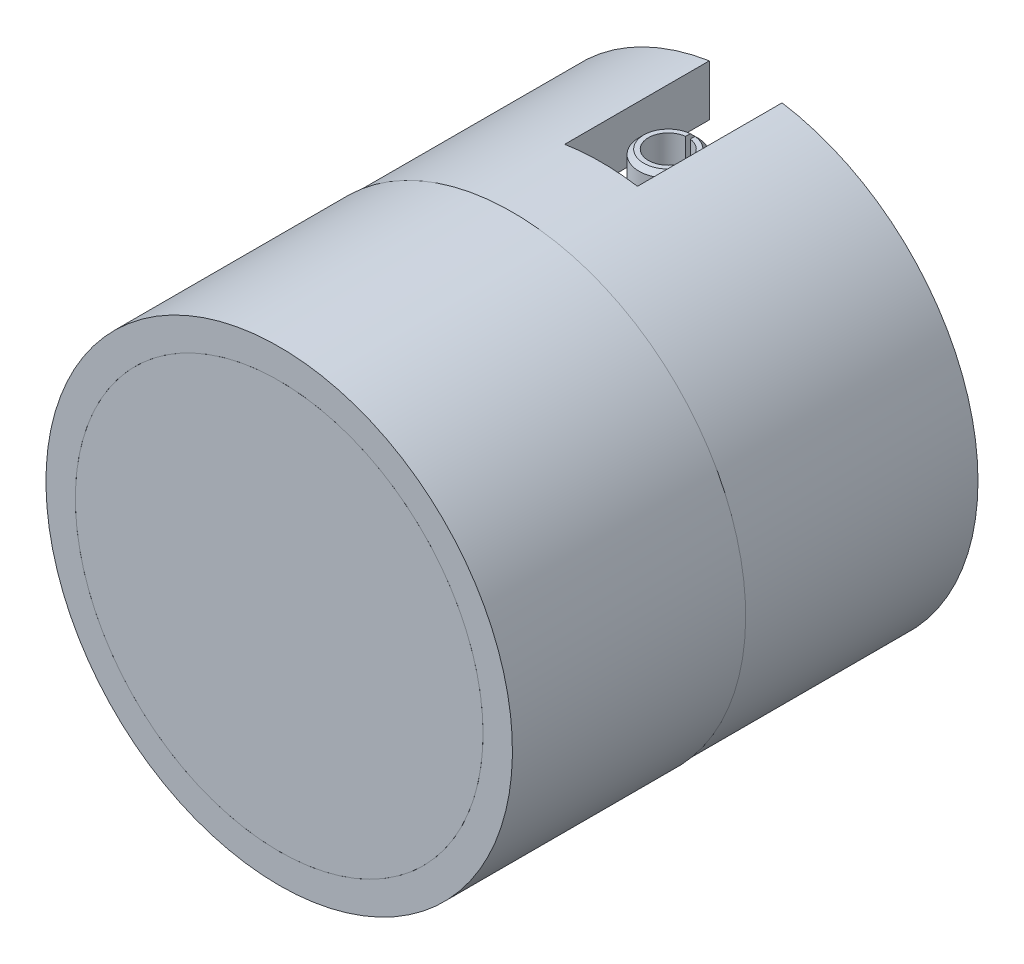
ISO-10303-21;
HEADER;
FILE_DESCRIPTION(('STEP AP214'),'2;1');
FILE_NAME('part.step','',(''),(''),'','','');
FILE_SCHEMA(('AUTOMOTIVE_DESIGN { 1 0 10303 214 1 1 1 1 }'));
ENDSEC;
DATA;
#1=APPLICATION_CONTEXT('core data for automotive mechanical design processes');
#2=APPLICATION_PROTOCOL_DEFINITION('international standard','automotive_design',2000,#1);
#3=PRODUCT_CONTEXT('',#1,'mechanical');
#4=PRODUCT('Part','Part','',(#3));
#5=PRODUCT_RELATED_PRODUCT_CATEGORY('part','',(#4));
#6=PRODUCT_DEFINITION_FORMATION('','',#4);
#7=PRODUCT_DEFINITION_CONTEXT('part definition',#1,'design');
#8=PRODUCT_DEFINITION('design','',#6,#7);
#9=PRODUCT_DEFINITION_SHAPE('','',#8);
#10=(LENGTH_UNIT() NAMED_UNIT(*) SI_UNIT(.MILLI.,.METRE.));
#11=(NAMED_UNIT(*) PLANE_ANGLE_UNIT() SI_UNIT($,.RADIAN.));
#12=(NAMED_UNIT(*) SI_UNIT($,.STERADIAN.) SOLID_ANGLE_UNIT());
#13=UNCERTAINTY_MEASURE_WITH_UNIT(LENGTH_MEASURE(1.E-05),#10,'distance_accuracy_value','');
#14=(GEOMETRIC_REPRESENTATION_CONTEXT(3) GLOBAL_UNCERTAINTY_ASSIGNED_CONTEXT((#13)) GLOBAL_UNIT_ASSIGNED_CONTEXT((#10,
#11,#12)) REPRESENTATION_CONTEXT('',''));
#15=CARTESIAN_POINT('',(0.,0.,0.));
#16=DIRECTION('',(0.,0.,1.));
#17=DIRECTION('',(1.,0.,0.));
#18=AXIS2_PLACEMENT_3D('',#15,#16,#17);
#19=CARTESIAN_POINT('',(0.,0.,0.));
#20=DIRECTION('',(0.,0.,1.));
#21=DIRECTION('',(0.,-1.,0.));
#22=AXIS2_PLACEMENT_3D('',#19,#20,#21);
#23=CYLINDRICAL_SURFACE('',#22,6.3246);
#24=CARTESIAN_POINT('',(0.,0.,-6.35));
#25=DIRECTION('',(0.,0.,1.));
#26=DIRECTION('',(0.,-1.,0.));
#27=AXIS2_PLACEMENT_3D('',#24,#25,#26);
#28=CIRCLE('',#27,6.3246);
#29=CARTESIAN_POINT('',(0.,-6.3246,-6.35));
#30=VERTEX_POINT('',#29);
#31=EDGE_CURVE('P0_E137',#30,#30,#28,.T.);
#32=ORIENTED_EDGE('',*,*,#31,.F.);
#33=EDGE_LOOP('',(#32));
#34=FACE_BOUND('',#33,.T.);
#35=DIRECTION('',(0.,0.,1.));
#36=VECTOR('',#35,1.);
#37=CARTESIAN_POINT('',(-0.990599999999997,6.24654118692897,0.));
#38=LINE('',#37,#36);
#39=CARTESIAN_POINT('',(-0.9906,6.24654118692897,-12.7));
#40=VERTEX_POINT('',#39);
#41=CARTESIAN_POINT('',(-0.990599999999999,6.24654118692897,-8.763));
#42=VERTEX_POINT('',#41);
#43=EDGE_CURVE('P0_E165',#40,#42,#38,.T.);
#44=ORIENTED_EDGE('',*,*,#43,.F.);
#45=CARTESIAN_POINT('',(0.,0.,-12.7));
#46=DIRECTION('',(0.,0.,1.));
#47=DIRECTION('',(0.,-1.,0.));
#48=AXIS2_PLACEMENT_3D('',#45,#46,#47);
#49=CIRCLE('',#48,6.3246);
#50=CARTESIAN_POINT('',(-0.9906,-6.24654118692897,-12.7));
#51=VERTEX_POINT('',#50);
#52=EDGE_CURVE('P0_E134',#40,#51,#49,.T.);
#53=ORIENTED_EDGE('',*,*,#52,.T.);
#54=DIRECTION('',(0.,0.,1.));
#55=VECTOR('',#54,1.);
#56=CARTESIAN_POINT('',(-0.990599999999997,-6.24654118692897,0.));
#57=LINE('',#56,#55);
#58=CARTESIAN_POINT('',(-0.990599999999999,-6.24654118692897,-8.763));
#59=VERTEX_POINT('',#58);
#60=EDGE_CURVE('P0_E100',#59,#51,#57,.F.);
#61=ORIENTED_EDGE('',*,*,#60,.F.);
#62=CARTESIAN_POINT('',(0.,0.,-8.763));
#63=DIRECTION('',(0.,0.,1.));
#64=DIRECTION('',(1.,0.,0.));
#65=AXIS2_PLACEMENT_3D('',#62,#63,#64);
#66=CIRCLE('',#65,6.3246);
#67=CARTESIAN_POINT('',(0.990599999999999,-6.24654118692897,-8.763));
#68=VERTEX_POINT('',#67);
#69=EDGE_CURVE('P0_E91',#59,#68,#66,.T.);
#70=ORIENTED_EDGE('',*,*,#69,.T.);
#71=DIRECTION('',(0.,0.,1.));
#72=VECTOR('',#71,1.);
#73=CARTESIAN_POINT('',(0.990599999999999,-6.24654118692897,0.));
#74=LINE('',#73,#72);
#75=CARTESIAN_POINT('',(0.9906,-6.24654118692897,-12.7));
#76=VERTEX_POINT('',#75);
#77=EDGE_CURVE('P0_E78',#68,#76,#74,.F.);
#78=ORIENTED_EDGE('',*,*,#77,.T.);
#79=CARTESIAN_POINT('',(0.9906,6.24654118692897,-12.7));
#80=VERTEX_POINT('',#79);
#81=EDGE_CURVE('P0_E135',#76,#80,#49,.T.);
#82=ORIENTED_EDGE('',*,*,#81,.T.);
#83=DIRECTION('',(0.,0.,1.));
#84=VECTOR('',#83,1.);
#85=CARTESIAN_POINT('',(0.990599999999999,6.24654118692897,0.));
#86=LINE('',#85,#84);
#87=CARTESIAN_POINT('',(0.990599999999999,6.24654118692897,-8.763));
#88=VERTEX_POINT('',#87);
#89=EDGE_CURVE('P0_E175',#80,#88,#86,.T.);
#90=ORIENTED_EDGE('',*,*,#89,.T.);
#91=EDGE_CURVE('P0_E101',#88,#42,#66,.T.);
#92=ORIENTED_EDGE('',*,*,#91,.T.);
#93=EDGE_LOOP('',(#44,#53,#61,#70,#78,#82,#90,#92));
#94=FACE_BOUND('',#93,.T.);
#95=ADVANCED_FACE('P0_F16',(#34,#94),#23,.T.);
#96=CARTESIAN_POINT('',(0.,6.3246,-12.7));
#97=DIRECTION('',(0.,0.,1.));
#98=DIRECTION('',(0.,-1.,0.));
#99=AXIS2_PLACEMENT_3D('',#96,#97,#98);
#100=PLANE('',#99);
#101=DIRECTION('',(0.,1.,0.));
#102=VECTOR('',#101,1.);
#103=CARTESIAN_POINT('',(-0.9906,6.3246,-12.7));
#104=LINE('',#103,#102);
#105=CARTESIAN_POINT('',(-0.990599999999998,-4.85292907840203,-12.7));
#106=VERTEX_POINT('',#105);
#107=EDGE_CURVE('P0_E105',#51,#106,#104,.T.);
#108=ORIENTED_EDGE('',*,*,#107,.F.);
#109=ORIENTED_EDGE('',*,*,#52,.F.);
#110=CARTESIAN_POINT('',(-0.990599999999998,4.85292907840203,-12.7));
#111=VERTEX_POINT('',#110);
#112=EDGE_CURVE('P0_E86',#111,#40,#104,.T.);
#113=ORIENTED_EDGE('',*,*,#112,.F.);
#114=CARTESIAN_POINT('',(0.,0.,-12.7));
#115=DIRECTION('',(0.,0.,-1.));
#116=DIRECTION('',(0.,1.,0.));
#117=AXIS2_PLACEMENT_3D('',#114,#115,#116);
#118=CIRCLE('',#117,4.953);
#119=EDGE_CURVE('P0_E104',#106,#111,#118,.T.);
#120=ORIENTED_EDGE('',*,*,#119,.F.);
#121=EDGE_LOOP('',(#108,#109,#113,#120));
#122=FACE_BOUND('',#121,.T.);
#123=ADVANCED_FACE('P0_F162',(#122),#100,.F.);
#124=CARTESIAN_POINT('',(0.,0.,-4.064));
#125=DIRECTION('',(0.,0.,-1.));
#126=DIRECTION('',(0.,1.,0.));
#127=AXIS2_PLACEMENT_3D('',#124,#125,#126);
#128=CYLINDRICAL_SURFACE('',#127,4.953);
#129=CARTESIAN_POINT('',(0.,0.,-4.064));
#130=DIRECTION('',(0.,0.,-1.));
#131=DIRECTION('',(0.,1.,0.));
#132=AXIS2_PLACEMENT_3D('',#129,#130,#131);
#133=CIRCLE('',#132,4.953);
#134=CARTESIAN_POINT('',(0.,4.953,-4.064));
#135=VERTEX_POINT('',#134);
#136=EDGE_CURVE('P0_E109',#135,#135,#133,.T.);
#137=ORIENTED_EDGE('',*,*,#136,.F.);
#138=EDGE_LOOP('',(#137));
#139=FACE_BOUND('',#138,.T.);
#140=DIRECTION('',(0.,0.,-1.));
#141=VECTOR('',#140,1.);
#142=CARTESIAN_POINT('',(-0.990599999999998,-4.85292907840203,-4.064));
#143=LINE('',#142,#141);
#144=CARTESIAN_POINT('',(-0.990599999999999,-4.85292907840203,-8.763));
#145=VERTEX_POINT('',#144);
#146=EDGE_CURVE('P0_E10',#106,#145,#143,.F.);
#147=ORIENTED_EDGE('',*,*,#146,.F.);
#148=ORIENTED_EDGE('',*,*,#119,.T.);
#149=DIRECTION('',(0.,0.,-1.));
#150=VECTOR('',#149,1.);
#151=CARTESIAN_POINT('',(-0.990599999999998,4.85292907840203,-4.064));
#152=LINE('',#151,#150);
#153=CARTESIAN_POINT('',(-0.990599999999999,4.85292907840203,-8.763));
#154=VERTEX_POINT('',#153);
#155=EDGE_CURVE('P0_E150',#154,#111,#152,.T.);
#156=ORIENTED_EDGE('',*,*,#155,.F.);
#157=CARTESIAN_POINT('',(0.,0.,-8.763));
#158=DIRECTION('',(0.,0.,1.));
#159=DIRECTION('',(1.,0.,0.));
#160=AXIS2_PLACEMENT_3D('',#157,#158,#159);
#161=CIRCLE('',#160,4.953);
#162=CARTESIAN_POINT('',(0.990599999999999,4.85292907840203,-8.763));
#163=VERTEX_POINT('',#162);
#164=EDGE_CURVE('P0_E147',#154,#163,#161,.F.);
#165=ORIENTED_EDGE('',*,*,#164,.T.);
#166=DIRECTION('',(0.,0.,-1.));
#167=VECTOR('',#166,1.);
#168=CARTESIAN_POINT('',(0.990599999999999,4.85292907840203,-4.064));
#169=LINE('',#168,#167);
#170=CARTESIAN_POINT('',(0.990599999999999,4.85292907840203,-12.7));
#171=VERTEX_POINT('',#170);
#172=EDGE_CURVE('P0_E143',#163,#171,#169,.T.);
#173=ORIENTED_EDGE('',*,*,#172,.T.);
#174=CARTESIAN_POINT('',(0.990599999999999,-4.85292907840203,-12.7));
#175=VERTEX_POINT('',#174);
#176=EDGE_CURVE('P0_E113',#171,#175,#118,.T.);
#177=ORIENTED_EDGE('',*,*,#176,.T.);
#178=DIRECTION('',(0.,0.,-1.));
#179=VECTOR('',#178,1.);
#180=CARTESIAN_POINT('',(0.990599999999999,-4.85292907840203,-4.064));
#181=LINE('',#180,#179);
#182=CARTESIAN_POINT('',(0.990599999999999,-4.85292907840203,-8.763));
#183=VERTEX_POINT('',#182);
#184=EDGE_CURVE('P0_E151',#175,#183,#181,.F.);
#185=ORIENTED_EDGE('',*,*,#184,.T.);
#186=EDGE_CURVE('P0_E24',#183,#145,#161,.F.);
#187=ORIENTED_EDGE('',*,*,#186,.T.);
#188=EDGE_LOOP('',(#147,#148,#156,#165,#173,#177,#185,#187));
#189=FACE_BOUND('',#188,.T.);
#190=ADVANCED_FACE('P0_F154',(#139,#189),#128,.F.);
#191=CARTESIAN_POINT('',(0.,0.,0.));
#192=DIRECTION('',(0.,0.,-1.));
#193=DIRECTION('',(0.,1.,0.));
#194=AXIS2_PLACEMENT_3D('',#191,#192,#193);
#195=CYLINDRICAL_SURFACE('',#194,2.159);
#196=CARTESIAN_POINT('',(0.,0.,-3.01397045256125));
#197=DIRECTION('',(0.,0.,1.));
#198=DIRECTION('',(1.,0.,0.));
#199=AXIS2_PLACEMENT_3D('',#196,#197,#198);
#200=CIRCLE('',#199,2.159);
#201=CARTESIAN_POINT('',(2.159,0.,-3.01397045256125));
#202=VERTEX_POINT('',#201);
#203=EDGE_CURVE('P0_E119',#202,#202,#200,.T.);
#204=ORIENTED_EDGE('',*,*,#203,.T.);
#205=EDGE_LOOP('',(#204));
#206=FACE_BOUND('',#205,.T.);
#207=CARTESIAN_POINT('',(0.,0.,-4.064));
#208=DIRECTION('',(0.,0.,-1.));
#209=DIRECTION('',(0.,1.,0.));
#210=AXIS2_PLACEMENT_3D('',#207,#208,#209);
#211=CIRCLE('',#210,2.159);
#212=CARTESIAN_POINT('',(0.,2.159,-4.064));
#213=VERTEX_POINT('',#212);
#214=EDGE_CURVE('P0_E112',#213,#213,#211,.F.);
#215=ORIENTED_EDGE('',*,*,#214,.F.);
#216=EDGE_LOOP('',(#215));
#217=FACE_BOUND('',#216,.T.);
#218=ADVANCED_FACE('P0_F217',(#206,#217),#195,.F.);
#219=CARTESIAN_POINT('',(0.,0.,0.));
#220=DIRECTION('',(0.,0.,1.));
#221=DIRECTION('',(0.,-1.,0.));
#222=AXIS2_PLACEMENT_3D('',#219,#220,#221);
#223=CYLINDRICAL_SURFACE('',#222,6.35);
#224=CARTESIAN_POINT('',(0.,0.,0.));
#225=DIRECTION('',(0.,0.,1.));
#226=DIRECTION('',(0.,-1.,0.));
#227=AXIS2_PLACEMENT_3D('',#224,#225,#226);
#228=CIRCLE('',#227,6.35);
#229=CARTESIAN_POINT('',(0.,-6.35,0.));
#230=VERTEX_POINT('',#229);
#231=EDGE_CURVE('P0_E125',#230,#230,#228,.T.);
#232=ORIENTED_EDGE('',*,*,#231,.F.);
#233=EDGE_LOOP('',(#232));
#234=FACE_BOUND('',#233,.T.);
#235=CARTESIAN_POINT('',(0.,0.,-6.35));
#236=DIRECTION('',(0.,0.,1.));
#237=DIRECTION('',(0.,-1.,0.));
#238=AXIS2_PLACEMENT_3D('',#235,#236,#237);
#239=CIRCLE('',#238,6.35);
#240=CARTESIAN_POINT('',(0.,-6.35,-6.35));
#241=VERTEX_POINT('',#240);
#242=EDGE_CURVE('P0_E140',#241,#241,#239,.T.);
#243=ORIENTED_EDGE('',*,*,#242,.T.);
#244=EDGE_LOOP('',(#243));
#245=FACE_BOUND('',#244,.T.);
#246=ADVANCED_FACE('P0_F18',(#234,#245),#223,.T.);
#247=CARTESIAN_POINT('',(0.,6.35,-6.35));
#248=DIRECTION('',(0.,0.,1.));
#249=DIRECTION('',(0.,-1.,0.));
#250=AXIS2_PLACEMENT_3D('',#247,#248,#249);
#251=PLANE('',#250);
#252=ORIENTED_EDGE('',*,*,#242,.F.);
#253=EDGE_LOOP('',(#252));
#254=FACE_BOUND('',#253,.T.);
#255=ORIENTED_EDGE('',*,*,#31,.T.);
#256=EDGE_LOOP('',(#255));
#257=FACE_BOUND('',#256,.T.);
#258=ADVANCED_FACE('P0_F209',(#254,#257),#251,.F.);
#259=ORIENTED_EDGE('',*,*,#81,.F.);
#260=DIRECTION('',(0.,1.,0.));
#261=VECTOR('',#260,1.);
#262=CARTESIAN_POINT('',(0.9906,6.3246,-12.7));
#263=LINE('',#262,#261);
#264=EDGE_CURVE('P0_E81',#76,#175,#263,.T.);
#265=ORIENTED_EDGE('',*,*,#264,.T.);
#266=ORIENTED_EDGE('',*,*,#176,.F.);
#267=EDGE_CURVE('P0_E39',#171,#80,#263,.T.);
#268=ORIENTED_EDGE('',*,*,#267,.T.);
#269=EDGE_LOOP('',(#259,#265,#266,#268));
#270=FACE_BOUND('',#269,.T.);
#271=ADVANCED_FACE('P0_F179',(#270),#100,.F.);
#272=CARTESIAN_POINT('',(0.,4.86930905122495,-2.54));
#273=DIRECTION('',(0.,0.,-1.));
#274=DIRECTION('',(0.,1.,0.));
#275=AXIS2_PLACEMENT_3D('',#272,#273,#274);
#276=PLANE('',#275);
#277=CARTESIAN_POINT('',(0.,0.,-2.54));
#278=DIRECTION('',(0.,0.,1.));
#279=DIRECTION('',(1.,0.,0.));
#280=AXIS2_PLACEMENT_3D('',#277,#278,#279);
#281=CIRCLE('',#280,2.54);
#282=CARTESIAN_POINT('',(2.54,0.,-2.54));
#283=VERTEX_POINT('',#282);
#284=EDGE_CURVE('P0_E122',#283,#283,#281,.T.);
#285=ORIENTED_EDGE('',*,*,#284,.F.);
#286=EDGE_LOOP('',(#285));
#287=FACE_BOUND('',#286,.T.);
#288=CARTESIAN_POINT('',(0.,0.,-2.54));
#289=DIRECTION('',(0.,0.,1.));
#290=DIRECTION('',(0.,-1.,0.));
#291=AXIS2_PLACEMENT_3D('',#288,#289,#290);
#292=CIRCLE('',#291,4.86930905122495);
#293=CARTESIAN_POINT('',(0.,-4.86930905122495,-2.54));
#294=VERTEX_POINT('',#293);
#295=EDGE_CURVE('P0_E131',#294,#294,#292,.T.);
#296=ORIENTED_EDGE('',*,*,#295,.T.);
#297=EDGE_LOOP('',(#296));
#298=FACE_BOUND('',#297,.T.);
#299=ADVANCED_FACE('P0_F216',(#287,#298),#276,.F.);
#300=CARTESIAN_POINT('',(0.,0.,0.));
#301=DIRECTION('',(0.,0.,1.));
#302=DIRECTION('',(0.,-1.,0.));
#303=AXIS2_PLACEMENT_3D('',#300,#301,#302);
#304=CONICAL_SURFACE('',#303,5.5499,0.26179938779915);
#305=ORIENTED_EDGE('',*,*,#295,.F.);
#306=EDGE_LOOP('',(#305));
#307=FACE_BOUND('',#306,.T.);
#308=CARTESIAN_POINT('',(0.,0.,0.));
#309=DIRECTION('',(0.,0.,1.));
#310=DIRECTION('',(0.,-1.,0.));
#311=AXIS2_PLACEMENT_3D('',#308,#309,#310);
#312=CIRCLE('',#311,5.5499);
#313=CARTESIAN_POINT('',(0.,-5.5499,0.));
#314=VERTEX_POINT('',#313);
#315=EDGE_CURVE('P0_E128',#314,#314,#312,.T.);
#316=ORIENTED_EDGE('',*,*,#315,.T.);
#317=EDGE_LOOP('',(#316));
#318=FACE_BOUND('',#317,.T.);
#319=ADVANCED_FACE('P0_F232',(#307,#318),#304,.F.);
#320=CARTESIAN_POINT('',(0.,5.5499,0.));
#321=DIRECTION('',(0.,0.,-1.));
#322=DIRECTION('',(0.,1.,0.));
#323=AXIS2_PLACEMENT_3D('',#320,#321,#322);
#324=PLANE('',#323);
#325=ORIENTED_EDGE('',*,*,#315,.F.);
#326=EDGE_LOOP('',(#325));
#327=FACE_BOUND('',#326,.T.);
#328=ORIENTED_EDGE('',*,*,#231,.T.);
#329=EDGE_LOOP('',(#328));
#330=FACE_BOUND('',#329,.T.);
#331=ADVANCED_FACE('P0_F229',(#327,#330),#324,.F.);
#332=CARTESIAN_POINT('',(0.,0.,-2.794));
#333=DIRECTION('',(0.,0.,1.));
#334=DIRECTION('',(1.,0.,0.));
#335=AXIS2_PLACEMENT_3D('',#332,#333,#334);
#336=CYLINDRICAL_SURFACE('',#335,2.54);
#337=CARTESIAN_POINT('',(0.,0.,-2.794));
#338=DIRECTION('',(0.,0.,1.));
#339=DIRECTION('',(1.,0.,0.));
#340=AXIS2_PLACEMENT_3D('',#337,#338,#339);
#341=CIRCLE('',#340,2.54);
#342=CARTESIAN_POINT('',(2.54,0.,-2.794));
#343=VERTEX_POINT('',#342);
#344=EDGE_CURVE('P0_E116',#343,#343,#341,.T.);
#345=ORIENTED_EDGE('',*,*,#344,.F.);
#346=EDGE_LOOP('',(#345));
#347=FACE_BOUND('',#346,.T.);
#348=ORIENTED_EDGE('',*,*,#284,.T.);
#349=EDGE_LOOP('',(#348));
#350=FACE_BOUND('',#349,.T.);
#351=ADVANCED_FACE('P0_F231',(#347,#350),#336,.F.);
#352=CARTESIAN_POINT('',(0.,0.,-2.794));
#353=DIRECTION('',(0.,0.,1.));
#354=DIRECTION('',(1.,0.,0.));
#355=AXIS2_PLACEMENT_3D('',#352,#353,#354);
#356=CONICAL_SURFACE('',#355,2.54,1.0471975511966);
#357=ORIENTED_EDGE('',*,*,#344,.T.);
#358=EDGE_LOOP('',(#357));
#359=FACE_BOUND('',#358,.T.);
#360=ORIENTED_EDGE('',*,*,#203,.F.);
#361=EDGE_LOOP('',(#360));
#362=FACE_BOUND('',#361,.T.);
#363=ADVANCED_FACE('P0_F195',(#359,#362),#356,.F.);
#364=CARTESIAN_POINT('',(0.,0.,-4.064));
#365=DIRECTION('',(0.,0.,-1.));
#366=DIRECTION('',(0.,1.,0.));
#367=AXIS2_PLACEMENT_3D('',#364,#365,#366);
#368=PLANE('',#367);
#369=ORIENTED_EDGE('',*,*,#136,.T.);
#370=EDGE_LOOP('',(#369));
#371=FACE_BOUND('',#370,.T.);
#372=ORIENTED_EDGE('',*,*,#214,.T.);
#373=EDGE_LOOP('',(#372));
#374=FACE_BOUND('',#373,.T.);
#375=ADVANCED_FACE('P0_F187',(#371,#374),#368,.T.);
#376=CARTESIAN_POINT('',(-0.990599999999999,-6.35,-8.763));
#377=DIRECTION('',(1.,0.,0.));
#378=DIRECTION('',(0.,0.,-1.));
#379=AXIS2_PLACEMENT_3D('',#376,#377,#378);
#380=PLANE('',#379);
#381=ORIENTED_EDGE('',*,*,#43,.T.);
#382=DIRECTION('',(0.,1.,0.));
#383=VECTOR('',#382,1.);
#384=CARTESIAN_POINT('',(-0.990599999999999,-6.35,-8.763));
#385=LINE('',#384,#383);
#386=EDGE_CURVE('P0_E169',#154,#42,#385,.T.);
#387=ORIENTED_EDGE('',*,*,#386,.F.);
#388=ORIENTED_EDGE('',*,*,#155,.T.);
#389=ORIENTED_EDGE('',*,*,#112,.T.);
#390=EDGE_LOOP('',(#381,#387,#388,#389));
#391=FACE_BOUND('',#390,.T.);
#392=ADVANCED_FACE('P0_F185',(#391),#380,.T.);
#393=CARTESIAN_POINT('',(0.990599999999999,-6.35,-9.6266));
#394=DIRECTION('',(1.,0.,0.));
#395=DIRECTION('',(0.,0.,-1.));
#396=AXIS2_PLACEMENT_3D('',#393,#394,#395);
#397=PLANE('',#396);
#398=ORIENTED_EDGE('',*,*,#267,.F.);
#399=ORIENTED_EDGE('',*,*,#172,.F.);
#400=DIRECTION('',(0.,1.,0.));
#401=VECTOR('',#400,1.);
#402=CARTESIAN_POINT('',(0.990599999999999,-6.35,-8.763));
#403=LINE('',#402,#401);
#404=EDGE_CURVE('P0_E95',#163,#88,#403,.T.);
#405=ORIENTED_EDGE('',*,*,#404,.T.);
#406=ORIENTED_EDGE('',*,*,#89,.F.);
#407=EDGE_LOOP('',(#398,#399,#405,#406));
#408=FACE_BOUND('',#407,.T.);
#409=ADVANCED_FACE('P0_F181',(#408),#397,.F.);
#410=CARTESIAN_POINT('',(0.126999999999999,-6.35,-8.763));
#411=DIRECTION('',(0.,0.,1.));
#412=DIRECTION('',(1.,0.,0.));
#413=AXIS2_PLACEMENT_3D('',#410,#411,#412);
#414=PLANE('',#413);
#415=ORIENTED_EDGE('',*,*,#404,.F.);
#416=ORIENTED_EDGE('',*,*,#164,.F.);
#417=ORIENTED_EDGE('',*,*,#386,.T.);
#418=ORIENTED_EDGE('',*,*,#91,.F.);
#419=EDGE_LOOP('',(#415,#416,#417,#418));
#420=FACE_BOUND('',#419,.T.);
#421=ADVANCED_FACE('P0_F183',(#420),#414,.F.);
#422=EDGE_CURVE('P0_E168',#59,#145,#385,.T.);
#423=ORIENTED_EDGE('',*,*,#422,.T.);
#424=ORIENTED_EDGE('',*,*,#186,.F.);
#425=EDGE_CURVE('P0_E31',#68,#183,#403,.T.);
#426=ORIENTED_EDGE('',*,*,#425,.F.);
#427=ORIENTED_EDGE('',*,*,#69,.F.);
#428=EDGE_LOOP('',(#423,#424,#426,#427));
#429=FACE_BOUND('',#428,.T.);
#430=ADVANCED_FACE('P0_F90',(#429),#414,.F.);
#431=ORIENTED_EDGE('',*,*,#60,.T.);
#432=ORIENTED_EDGE('',*,*,#107,.T.);
#433=ORIENTED_EDGE('',*,*,#146,.T.);
#434=ORIENTED_EDGE('',*,*,#422,.F.);
#435=EDGE_LOOP('',(#431,#432,#433,#434));
#436=FACE_BOUND('',#435,.T.);
#437=ADVANCED_FACE('P0_F167',(#436),#380,.T.);
#438=ORIENTED_EDGE('',*,*,#425,.T.);
#439=ORIENTED_EDGE('',*,*,#184,.F.);
#440=ORIENTED_EDGE('',*,*,#264,.F.);
#441=ORIENTED_EDGE('',*,*,#77,.F.);
#442=EDGE_LOOP('',(#438,#439,#440,#441));
#443=FACE_BOUND('',#442,.T.);
#444=ADVANCED_FACE('P0_F79',(#443),#397,.F.);
#445=CLOSED_SHELL('',(#95,#123,#190,#218,#246,#258,#271,#299,#319,#331,#351,#363,#375,#392,#409,
#421,#430,#437,#444));
#446=MANIFOLD_SOLID_BREP('P0_B1',#445);
#447=CARTESIAN_POINT('',(0.,5.715,-10.5918));
#448=DIRECTION('',(0.,-1.,0.));
#449=DIRECTION('',(-1.,0.,0.));
#450=AXIS2_PLACEMENT_3D('',#447,#448,#449);
#451=CYLINDRICAL_SURFACE('',#450,0.53975);
#452=CARTESIAN_POINT('',(0.,-5.715,-10.5918));
#453=DIRECTION('',(0.,-1.,0.));
#454=DIRECTION('',(1.,0.,0.));
#455=AXIS2_PLACEMENT_3D('',#452,#453,#454);
#456=CIRCLE('',#455,0.53975);
#457=CARTESIAN_POINT('',(0.0635000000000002,-5.715,-11.1278016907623));
#458=VERTEX_POINT('',#457);
#459=CARTESIAN_POINT('',(-0.0634999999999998,-5.715,-11.1278016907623));
#460=VERTEX_POINT('',#459);
#461=EDGE_CURVE('P1_E91',#458,#460,#456,.T.);
#462=ORIENTED_EDGE('',*,*,#461,.T.);
#463=DIRECTION('',(0.,-1.,0.));
#464=VECTOR('',#463,1.);
#465=CARTESIAN_POINT('',(-0.0634999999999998,5.715,-11.1278016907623));
#466=LINE('',#465,#464);
#467=CARTESIAN_POINT('',(-0.0634999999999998,5.715,-11.1278016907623));
#468=VERTEX_POINT('',#467);
#469=EDGE_CURVE('P1_E75',#468,#460,#466,.T.);
#470=ORIENTED_EDGE('',*,*,#469,.F.);
#471=CARTESIAN_POINT('',(0.,5.715,-10.5918));
#472=DIRECTION('',(0.,-1.,0.));
#473=DIRECTION('',(1.,0.,0.));
#474=AXIS2_PLACEMENT_3D('',#471,#472,#473);
#475=CIRCLE('',#474,0.53975);
#476=CARTESIAN_POINT('',(0.0635000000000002,5.715,-11.1278016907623));
#477=VERTEX_POINT('',#476);
#478=EDGE_CURVE('P1_E80',#477,#468,#475,.T.);
#479=ORIENTED_EDGE('',*,*,#478,.F.);
#480=DIRECTION('',(0.,-1.,0.));
#481=VECTOR('',#480,1.);
#482=CARTESIAN_POINT('',(0.0635000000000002,5.715,-11.1278016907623));
#483=LINE('',#482,#481);
#484=EDGE_CURVE('P1_E238',#477,#458,#483,.T.);
#485=ORIENTED_EDGE('',*,*,#484,.T.);
#486=EDGE_LOOP('',(#462,#470,#479,#485));
#487=FACE_BOUND('',#486,.T.);
#488=ADVANCED_FACE('P1_F17',(#487),#451,.F.);
#489=CARTESIAN_POINT('',(-0.0634999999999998,5.715,-11.3830059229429));
#490=DIRECTION('',(-1.,0.,0.));
#491=DIRECTION('',(0.,0.,1.));
#492=AXIS2_PLACEMENT_3D('',#489,#490,#491);
#493=PLANE('',#492);
#494=DIRECTION('',(0.,0.,-1.));
#495=VECTOR('',#494,1.);
#496=CARTESIAN_POINT('',(-0.0634999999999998,-5.715,-11.3830059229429));
#497=LINE('',#496,#495);
#498=CARTESIAN_POINT('',(-0.0634999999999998,-5.715,-11.2555193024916));
#499=VERTEX_POINT('',#498);
#500=EDGE_CURVE('P1_E230',#460,#499,#497,.T.);
#501=ORIENTED_EDGE('',*,*,#500,.T.);
#502=CARTESIAN_POINT('',(-0.0634999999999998,-5.715,-11.2555193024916));
#503=CARTESIAN_POINT('',(-0.0634999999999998,-5.69384042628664,-11.2767741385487));
#504=CARTESIAN_POINT('',(-0.0634999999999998,-5.67267730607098,-11.2980254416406));
#505=CARTESIAN_POINT('',(-0.0634999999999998,-5.63034397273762,-11.340520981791));
#506=CARTESIAN_POINT('',(-0.0634999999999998,-5.60917375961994,-11.3617652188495));
#507=CARTESIAN_POINT('',(-0.0634999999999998,-5.588,-11.3830059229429));
#508=B_SPLINE_CURVE_WITH_KNOTS('',3,(#502,#503,#504,#505,#506,#507),.UNSPECIFIED.,.F.,.F.,(4,2,
4),(0.,0.0899747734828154,0.179949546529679),.UNSPECIFIED.);
#509=CARTESIAN_POINT('',(-0.0634999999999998,-5.588,-11.3830059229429));
#510=VERTEX_POINT('',#509);
#511=EDGE_CURVE('P1_E26',#499,#510,#508,.T.);
#512=ORIENTED_EDGE('',*,*,#511,.T.);
#513=DIRECTION('',(0.,-1.,0.));
#514=VECTOR('',#513,1.);
#515=CARTESIAN_POINT('',(-0.0634999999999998,5.715,-11.3830059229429));
#516=LINE('',#515,#514);
#517=CARTESIAN_POINT('',(-0.0634999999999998,5.588,-11.3830059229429));
#518=VERTEX_POINT('',#517);
#519=EDGE_CURVE('P1_E93',#518,#510,#516,.T.);
#520=ORIENTED_EDGE('',*,*,#519,.F.);
#521=CARTESIAN_POINT('',(-0.0634999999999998,5.588,-11.3830059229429));
#522=CARTESIAN_POINT('',(-0.0634999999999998,5.60917375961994,-11.3617652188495));
#523=CARTESIAN_POINT('',(-0.0634999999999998,5.63034397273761,-11.340520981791));
#524=CARTESIAN_POINT('',(-0.0634999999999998,5.67267730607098,-11.2980254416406));
#525=CARTESIAN_POINT('',(-0.0634999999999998,5.69384042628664,-11.2767741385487));
#526=CARTESIAN_POINT('',(-0.0634999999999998,5.715,-11.2555193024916));
#527=B_SPLINE_CURVE_WITH_KNOTS('',3,(#521,#522,#523,#524,#525,#526),.UNSPECIFIED.,.F.,.F.,(4,2,
4),(0.,0.0899747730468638,0.17994954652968),.UNSPECIFIED.);
#528=CARTESIAN_POINT('',(-0.0634999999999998,5.715,-11.2555193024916));
#529=VERTEX_POINT('',#528);
#530=EDGE_CURVE('P1_E33',#518,#529,#527,.T.);
#531=ORIENTED_EDGE('',*,*,#530,.T.);
#532=DIRECTION('',(0.,0.,-1.));
#533=VECTOR('',#532,1.);
#534=CARTESIAN_POINT('',(-0.0634999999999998,5.715,-11.3830059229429));
#535=LINE('',#534,#533);
#536=EDGE_CURVE('P1_E71',#468,#529,#535,.T.);
#537=ORIENTED_EDGE('',*,*,#536,.F.);
#538=ORIENTED_EDGE('',*,*,#469,.T.);
#539=EDGE_LOOP('',(#501,#512,#520,#531,#537,#538));
#540=FACE_BOUND('',#539,.T.);
#541=ADVANCED_FACE('P1_F73',(#540),#493,.F.);
#542=CARTESIAN_POINT('',(0.,5.715,-10.5918));
#543=DIRECTION('',(0.,-1.,0.));
#544=DIRECTION('',(-1.,0.,0.));
#545=AXIS2_PLACEMENT_3D('',#542,#543,#544);
#546=CYLINDRICAL_SURFACE('',#545,0.79375);
#547=ORIENTED_EDGE('',*,*,#519,.T.);
#548=CARTESIAN_POINT('',(0.,-5.588,-10.5918));
#549=DIRECTION('',(0.,1.,0.));
#550=DIRECTION('',(1.,0.,0.));
#551=AXIS2_PLACEMENT_3D('',#548,#549,#550);
#552=CIRCLE('',#551,0.79375);
#553=CARTESIAN_POINT('',(0.0634999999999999,-5.588,-11.3830059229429));
#554=VERTEX_POINT('',#553);
#555=EDGE_CURVE('P1_E95',#510,#554,#552,.T.);
#556=ORIENTED_EDGE('',*,*,#555,.T.);
#557=DIRECTION('',(0.,-1.,0.));
#558=VECTOR('',#557,1.);
#559=CARTESIAN_POINT('',(0.0634999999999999,5.715,-11.3830059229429));
#560=LINE('',#559,#558);
#561=CARTESIAN_POINT('',(0.0634999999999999,5.588,-11.3830059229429));
#562=VERTEX_POINT('',#561);
#563=EDGE_CURVE('P1_E98',#562,#554,#560,.T.);
#564=ORIENTED_EDGE('',*,*,#563,.F.);
#565=CARTESIAN_POINT('',(0.,5.588,-10.5918));
#566=DIRECTION('',(0.,1.,0.));
#567=DIRECTION('',(1.,0.,0.));
#568=AXIS2_PLACEMENT_3D('',#565,#566,#567);
#569=CIRCLE('',#568,0.79375);
#570=EDGE_CURVE('P1_E92',#562,#518,#569,.F.);
#571=ORIENTED_EDGE('',*,*,#570,.T.);
#572=EDGE_LOOP('',(#547,#556,#564,#571));
#573=FACE_BOUND('',#572,.T.);
#574=ADVANCED_FACE('P1_F122',(#573),#546,.T.);
#575=CARTESIAN_POINT('',(0.0635000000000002,5.715,-11.3830059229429));
#576=DIRECTION('',(1.,0.,0.));
#577=DIRECTION('',(0.,0.,-1.));
#578=AXIS2_PLACEMENT_3D('',#575,#576,#577);
#579=PLANE('',#578);
#580=ORIENTED_EDGE('',*,*,#563,.T.);
#581=CARTESIAN_POINT('',(0.0634999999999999,-5.588,-11.3830059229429));
#582=CARTESIAN_POINT('',(0.0635000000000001,-5.60917375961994,-11.3617652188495));
#583=CARTESIAN_POINT('',(0.0635000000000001,-5.63034397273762,-11.340520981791));
#584=CARTESIAN_POINT('',(0.0635000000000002,-5.67267730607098,-11.2980254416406));
#585=CARTESIAN_POINT('',(0.0635000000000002,-5.69384042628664,-11.2767741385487));
#586=CARTESIAN_POINT('',(0.0635000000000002,-5.715,-11.2555193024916));
#587=B_SPLINE_CURVE_WITH_KNOTS('',3,(#581,#582,#583,#584,#585,#586),.UNSPECIFIED.,.F.,.F.,(4,2,
4),(0.,0.0899747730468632,0.179949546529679),.UNSPECIFIED.);
#588=CARTESIAN_POINT('',(0.0635000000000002,-5.715,-11.2555193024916));
#589=VERTEX_POINT('',#588);
#590=EDGE_CURVE('P1_E111',#554,#589,#587,.T.);
#591=ORIENTED_EDGE('',*,*,#590,.T.);
#592=DIRECTION('',(0.,0.,1.));
#593=VECTOR('',#592,1.);
#594=CARTESIAN_POINT('',(0.0635000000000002,-5.715,-11.3830059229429));
#595=LINE('',#594,#593);
#596=EDGE_CURVE('P1_E88',#589,#458,#595,.T.);
#597=ORIENTED_EDGE('',*,*,#596,.T.);
#598=ORIENTED_EDGE('',*,*,#484,.F.);
#599=DIRECTION('',(0.,0.,1.));
#600=VECTOR('',#599,1.);
#601=CARTESIAN_POINT('',(0.0635000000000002,5.715,-11.3830059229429));
#602=LINE('',#601,#600);
#603=CARTESIAN_POINT('',(0.0635000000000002,5.715,-11.2555193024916));
#604=VERTEX_POINT('',#603);
#605=EDGE_CURVE('P1_E79',#604,#477,#602,.T.);
#606=ORIENTED_EDGE('',*,*,#605,.F.);
#607=CARTESIAN_POINT('',(0.0635000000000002,5.715,-11.2555193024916));
#608=CARTESIAN_POINT('',(0.0635000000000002,5.69384042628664,-11.2767741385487));
#609=CARTESIAN_POINT('',(0.0635000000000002,5.67267730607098,-11.2980254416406));
#610=CARTESIAN_POINT('',(0.0635000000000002,5.63034397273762,-11.340520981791));
#611=CARTESIAN_POINT('',(0.0635000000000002,5.60917375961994,-11.3617652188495));
#612=CARTESIAN_POINT('',(0.0635000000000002,5.588,-11.3830059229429));
#613=B_SPLINE_CURVE_WITH_KNOTS('',3,(#607,#608,#609,#610,#611,#612),.UNSPECIFIED.,.F.,.F.,(4,2,
4),(0.,0.0899747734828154,0.179949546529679),.UNSPECIFIED.);
#614=EDGE_CURVE('P1_E104',#604,#562,#613,.T.);
#615=ORIENTED_EDGE('',*,*,#614,.T.);
#616=EDGE_LOOP('',(#580,#591,#597,#598,#606,#615));
#617=FACE_BOUND('',#616,.T.);
#618=ADVANCED_FACE('P1_F117',(#617),#579,.F.);
#619=CARTESIAN_POINT('',(0.,5.715,-10.5918));
#620=DIRECTION('',(0.,1.,0.));
#621=DIRECTION('',(1.,0.,0.));
#622=AXIS2_PLACEMENT_3D('',#619,#620,#621);
#623=PLANE('',#622);
#624=ORIENTED_EDGE('',*,*,#536,.T.);
#625=CARTESIAN_POINT('',(0.,5.715,-10.5918));
#626=DIRECTION('',(0.,1.,0.));
#627=DIRECTION('',(1.,0.,0.));
#628=AXIS2_PLACEMENT_3D('',#625,#626,#627);
#629=CIRCLE('',#628,0.666749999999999);
#630=EDGE_CURVE('P1_E11',#529,#604,#629,.T.);
#631=ORIENTED_EDGE('',*,*,#630,.T.);
#632=ORIENTED_EDGE('',*,*,#605,.T.);
#633=ORIENTED_EDGE('',*,*,#478,.T.);
#634=EDGE_LOOP('',(#624,#631,#632,#633));
#635=FACE_BOUND('',#634,.T.);
#636=ADVANCED_FACE('P1_F83',(#635),#623,.T.);
#637=CARTESIAN_POINT('',(0.,-5.715,-10.5918));
#638=DIRECTION('',(0.,1.,0.));
#639=DIRECTION('',(1.,0.,0.));
#640=AXIS2_PLACEMENT_3D('',#637,#638,#639);
#641=PLANE('',#640);
#642=ORIENTED_EDGE('',*,*,#596,.F.);
#643=CARTESIAN_POINT('',(0.,-5.715,-10.5918));
#644=DIRECTION('',(0.,1.,0.));
#645=DIRECTION('',(1.,0.,0.));
#646=AXIS2_PLACEMENT_3D('',#643,#644,#645);
#647=CIRCLE('',#646,0.666749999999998);
#648=EDGE_CURVE('P1_E41',#589,#499,#647,.F.);
#649=ORIENTED_EDGE('',*,*,#648,.T.);
#650=ORIENTED_EDGE('',*,*,#500,.F.);
#651=ORIENTED_EDGE('',*,*,#461,.F.);
#652=EDGE_LOOP('',(#642,#649,#650,#651));
#653=FACE_BOUND('',#652,.T.);
#654=ADVANCED_FACE('P1_F124',(#653),#641,.F.);
#655=CARTESIAN_POINT('',(0.,-5.588,-10.5918));
#656=DIRECTION('',(0.,1.,0.));
#657=DIRECTION('',(1.,0.,0.));
#658=AXIS2_PLACEMENT_3D('',#655,#656,#657);
#659=CONICAL_SURFACE('',#658,0.79375,0.785398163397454);
#660=ORIENTED_EDGE('',*,*,#511,.F.);
#661=ORIENTED_EDGE('',*,*,#648,.F.);
#662=ORIENTED_EDGE('',*,*,#590,.F.);
#663=ORIENTED_EDGE('',*,*,#555,.F.);
#664=EDGE_LOOP('',(#660,#661,#662,#663));
#665=FACE_BOUND('',#664,.T.);
#666=ADVANCED_FACE('P1_F143',(#665),#659,.T.);
#667=CARTESIAN_POINT('',(0.,5.715,-10.5918));
#668=DIRECTION('',(0.,-1.,0.));
#669=DIRECTION('',(-1.,0.,0.));
#670=AXIS2_PLACEMENT_3D('',#667,#668,#669);
#671=CONICAL_SURFACE('',#670,0.666749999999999,0.785398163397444);
#672=ORIENTED_EDGE('',*,*,#530,.F.);
#673=ORIENTED_EDGE('',*,*,#570,.F.);
#674=ORIENTED_EDGE('',*,*,#614,.F.);
#675=ORIENTED_EDGE('',*,*,#630,.F.);
#676=EDGE_LOOP('',(#672,#673,#674,#675));
#677=FACE_BOUND('',#676,.T.);
#678=ADVANCED_FACE('P1_F19',(#677),#671,.T.);
#679=CLOSED_SHELL('',(#488,#541,#574,#618,#636,#654,#666,#678));
#680=MANIFOLD_SOLID_BREP('P1_B1',#679);
#681=CARTESIAN_POINT('',(4.3815,0.,-9.525));
#682=DIRECTION('',(0.,1.,0.));
#683=DIRECTION('',(0.,0.,1.));
#684=AXIS2_PLACEMENT_3D('',#681,#682,#683);
#685=PLANE('',#684);
#686=CARTESIAN_POINT('',(4.3815,0.,-9.525));
#687=DIRECTION('',(0.,1.,0.));
#688=DIRECTION('',(0.,0.,1.));
#689=AXIS2_PLACEMENT_3D('',#686,#687,#688);
#690=CIRCLE('',#689,0.381000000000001);
#691=CARTESIAN_POINT('',(4.3815,0.,-9.144));
#692=VERTEX_POINT('',#691);
#693=EDGE_CURVE('P2_E24',#692,#692,#690,.T.);
#694=ORIENTED_EDGE('',*,*,#693,.T.);
#695=EDGE_LOOP('',(#694));
#696=FACE_BOUND('',#695,.T.);
#697=ADVANCED_FACE('P2_F17',(#696),#685,.T.);
#698=CARTESIAN_POINT('',(4.3815,-3.05807628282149E-13,-4.445));
#699=DIRECTION('',(0.,1.,0.));
#700=DIRECTION('',(0.,0.,1.));
#701=AXIS2_PLACEMENT_3D('',#698,#699,#700);
#702=PLANE('',#701);
#703=CARTESIAN_POINT('',(4.3815,-3.05807628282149E-13,-4.445));
#704=DIRECTION('',(0.,1.,0.));
#705=DIRECTION('',(0.,0.,1.));
#706=AXIS2_PLACEMENT_3D('',#703,#704,#705);
#707=CIRCLE('',#706,0.381000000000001);
#708=CARTESIAN_POINT('',(4.3815,-3.05807628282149E-13,-4.064));
#709=VERTEX_POINT('',#708);
#710=EDGE_CURVE('P2_E11',#709,#709,#707,.T.);
#711=ORIENTED_EDGE('',*,*,#710,.F.);
#712=EDGE_LOOP('',(#711));
#713=FACE_BOUND('',#712,.T.);
#714=ADVANCED_FACE('P2_F33',(#713),#702,.F.);
#715=CARTESIAN_POINT('',(4.3815,0.,-9.144));
#716=CARTESIAN_POINT('',(4.3815,-2.52966020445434,-9.05933333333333));
#717=CARTESIAN_POINT('',(2.19075,-3.79449030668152,-8.97466666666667));
#718=CARTESIAN_POINT('',(0.,-5.05932040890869,-8.89));
#719=CARTESIAN_POINT('',(-2.19075,-3.79449030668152,-8.80533333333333));
#720=CARTESIAN_POINT('',(-4.3815,-2.52966020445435,-8.72066666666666));
#721=CARTESIAN_POINT('',(-4.3815,0.,-8.636));
#722=CARTESIAN_POINT('',(-4.3815,2.52966020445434,-8.55133333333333));
#723=CARTESIAN_POINT('',(-2.19075,3.79449030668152,-8.46666666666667));
#724=CARTESIAN_POINT('',(0.,5.05932040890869,-8.382));
#725=CARTESIAN_POINT('',(2.19075,3.79449030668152,-8.29733333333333));
#726=CARTESIAN_POINT('',(4.3815,2.52966020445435,-8.21266666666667));
#727=CARTESIAN_POINT('',(4.3815,0.,-8.128));
#728=CARTESIAN_POINT('',(4.3815,-2.52966020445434,-8.04333333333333));
#729=CARTESIAN_POINT('',(2.19075,-3.79449030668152,-7.95866666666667));
#730=CARTESIAN_POINT('',(0.,-5.05932040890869,-7.874));
#731=CARTESIAN_POINT('',(-2.19075,-3.79449030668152,-7.78933333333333));
#732=CARTESIAN_POINT('',(-4.3815,-2.52966020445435,-7.70466666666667));
#733=CARTESIAN_POINT('',(-4.3815,0.,-7.62));
#734=CARTESIAN_POINT('',(-4.3815,2.52966020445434,-7.53533333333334));
#735=CARTESIAN_POINT('',(-2.19075,3.79449030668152,-7.45066666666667));
#736=CARTESIAN_POINT('',(0.,5.05932040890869,-7.366));
#737=CARTESIAN_POINT('',(2.19075,3.79449030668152,-7.28133333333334));
#738=CARTESIAN_POINT('',(4.3815,2.52966020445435,-7.19666666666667));
#739=CARTESIAN_POINT('',(4.3815,0.,-7.112));
#740=CARTESIAN_POINT('',(4.3815,-2.52966020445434,-7.02733333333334));
#741=CARTESIAN_POINT('',(2.19075,-3.79449030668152,-6.94266666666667));
#742=CARTESIAN_POINT('',(0.,-5.05932040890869,-6.858));
#743=CARTESIAN_POINT('',(-2.19075,-3.79449030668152,-6.77333333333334));
#744=CARTESIAN_POINT('',(-4.3815,-2.52966020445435,-6.68866666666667));
#745=CARTESIAN_POINT('',(-4.3815,0.,-6.604));
#746=CARTESIAN_POINT('',(-4.3815,2.52966020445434,-6.51933333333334));
#747=CARTESIAN_POINT('',(-2.19075,3.79449030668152,-6.43466666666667));
#748=CARTESIAN_POINT('',(0.,5.05932040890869,-6.35));
#749=CARTESIAN_POINT('',(2.19075,3.79449030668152,-6.26533333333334));
#750=CARTESIAN_POINT('',(4.3815,2.52966020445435,-6.18066666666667));
#751=CARTESIAN_POINT('',(4.3815,0.,-6.09600000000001));
#752=CARTESIAN_POINT('',(4.3815,-2.52966020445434,-6.01133333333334));
#753=CARTESIAN_POINT('',(2.19075,-3.79449030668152,-5.92666666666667));
#754=CARTESIAN_POINT('',(0.,-5.05932040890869,-5.84200000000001));
#755=CARTESIAN_POINT('',(-2.19075,-3.79449030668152,-5.75733333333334));
#756=CARTESIAN_POINT('',(-4.3815,-2.52966020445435,-5.67266666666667));
#757=CARTESIAN_POINT('',(-4.3815,0.,-5.58800000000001));
#758=CARTESIAN_POINT('',(-4.3815,2.52966020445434,-5.50333333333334));
#759=CARTESIAN_POINT('',(-2.19075,3.79449030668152,-5.41866666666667));
#760=CARTESIAN_POINT('',(0.,5.05932040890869,-5.33400000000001));
#761=CARTESIAN_POINT('',(2.19075,3.79449030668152,-5.24933333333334));
#762=CARTESIAN_POINT('',(4.3815,2.52966020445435,-5.16466666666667));
#763=CARTESIAN_POINT('',(4.3815,0.,-5.08000000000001));
#764=CARTESIAN_POINT('',(4.3815,-2.52966020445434,-4.99533333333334));
#765=CARTESIAN_POINT('',(2.19075,-3.79449030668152,-4.91066666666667));
#766=CARTESIAN_POINT('',(0.,-5.05932040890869,-4.82600000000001));
#767=CARTESIAN_POINT('',(-2.19075,-3.79449030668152,-4.74133333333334));
#768=CARTESIAN_POINT('',(-4.3815,-2.52966020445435,-4.65666666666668));
#769=CARTESIAN_POINT('',(-4.3815,0.,-4.57200000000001));
#770=CARTESIAN_POINT('',(-4.3815,2.52966020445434,-4.48733333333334));
#771=CARTESIAN_POINT('',(-2.19075,3.79449030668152,-4.40266666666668));
#772=CARTESIAN_POINT('',(0.,5.05932040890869,-4.31800000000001));
#773=CARTESIAN_POINT('',(2.19075,3.79449030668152,-4.23333333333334));
#774=CARTESIAN_POINT('',(4.3815,2.52966020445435,-4.14866666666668));
#775=CARTESIAN_POINT('',(4.3815,0.,-4.06400000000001));
#776=CARTESIAN_POINT('',(5.1435,0.,-9.144));
#777=CARTESIAN_POINT('',(5.1435,-2.96960110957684,-9.05933333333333));
#778=CARTESIAN_POINT('',(2.57175,-4.45440166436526,-8.97466666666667));
#779=CARTESIAN_POINT('',(0.,-5.93920221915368,-8.89));
#780=CARTESIAN_POINT('',(-2.57175,-4.45440166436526,-8.80533333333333));
#781=CARTESIAN_POINT('',(-5.1435,-2.96960110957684,-8.72066666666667));
#782=CARTESIAN_POINT('',(-5.1435,0.,-8.636));
#783=CARTESIAN_POINT('',(-5.1435,2.96960110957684,-8.55133333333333));
#784=CARTESIAN_POINT('',(-2.57175,4.45440166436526,-8.46666666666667));
#785=CARTESIAN_POINT('',(0.,5.93920221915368,-8.382));
#786=CARTESIAN_POINT('',(2.57175,4.45440166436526,-8.29733333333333));
#787=CARTESIAN_POINT('',(5.1435,2.96960110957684,-8.21266666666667));
#788=CARTESIAN_POINT('',(5.1435,0.,-8.128));
#789=CARTESIAN_POINT('',(5.1435,-2.96960110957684,-8.04333333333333));
#790=CARTESIAN_POINT('',(2.57175,-4.45440166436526,-7.95866666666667));
#791=CARTESIAN_POINT('',(0.,-5.93920221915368,-7.874));
#792=CARTESIAN_POINT('',(-2.57175,-4.45440166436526,-7.78933333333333));
#793=CARTESIAN_POINT('',(-5.1435,-2.96960110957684,-7.70466666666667));
#794=CARTESIAN_POINT('',(-5.1435,0.,-7.62));
#795=CARTESIAN_POINT('',(-5.1435,2.96960110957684,-7.53533333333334));
#796=CARTESIAN_POINT('',(-2.57175,4.45440166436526,-7.45066666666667));
#797=CARTESIAN_POINT('',(0.,5.93920221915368,-7.366));
#798=CARTESIAN_POINT('',(2.57175,4.45440166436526,-7.28133333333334));
#799=CARTESIAN_POINT('',(5.1435,2.96960110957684,-7.19666666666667));
#800=CARTESIAN_POINT('',(5.1435,0.,-7.112));
#801=CARTESIAN_POINT('',(5.1435,-2.96960110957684,-7.02733333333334));
#802=CARTESIAN_POINT('',(2.57175,-4.45440166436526,-6.94266666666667));
#803=CARTESIAN_POINT('',(0.,-5.93920221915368,-6.858));
#804=CARTESIAN_POINT('',(-2.57175,-4.45440166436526,-6.77333333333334));
#805=CARTESIAN_POINT('',(-5.1435,-2.96960110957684,-6.68866666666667));
#806=CARTESIAN_POINT('',(-5.1435,0.,-6.604));
#807=CARTESIAN_POINT('',(-5.1435,2.96960110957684,-6.51933333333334));
#808=CARTESIAN_POINT('',(-2.57175,4.45440166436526,-6.43466666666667));
#809=CARTESIAN_POINT('',(0.,5.93920221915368,-6.35000000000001));
#810=CARTESIAN_POINT('',(2.57175,4.45440166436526,-6.26533333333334));
#811=CARTESIAN_POINT('',(5.1435,2.96960110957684,-6.18066666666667));
#812=CARTESIAN_POINT('',(5.1435,0.,-6.096));
#813=CARTESIAN_POINT('',(5.1435,-2.96960110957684,-6.01133333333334));
#814=CARTESIAN_POINT('',(2.57175,-4.45440166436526,-5.92666666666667));
#815=CARTESIAN_POINT('',(0.,-5.93920221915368,-5.84200000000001));
#816=CARTESIAN_POINT('',(-2.57175,-4.45440166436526,-5.75733333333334));
#817=CARTESIAN_POINT('',(-5.1435,-2.96960110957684,-5.67266666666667));
#818=CARTESIAN_POINT('',(-5.1435,0.,-5.58800000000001));
#819=CARTESIAN_POINT('',(-5.1435,2.96960110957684,-5.50333333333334));
#820=CARTESIAN_POINT('',(-2.57175,4.45440166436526,-5.41866666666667));
#821=CARTESIAN_POINT('',(0.,5.93920221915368,-5.33400000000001));
#822=CARTESIAN_POINT('',(2.57175,4.45440166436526,-5.24933333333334));
#823=CARTESIAN_POINT('',(5.1435,2.96960110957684,-5.16466666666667));
#824=CARTESIAN_POINT('',(5.1435,0.,-5.08000000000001));
#825=CARTESIAN_POINT('',(5.1435,-2.96960110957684,-4.99533333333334));
#826=CARTESIAN_POINT('',(2.57175,-4.45440166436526,-4.91066666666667));
#827=CARTESIAN_POINT('',(0.,-5.93920221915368,-4.82600000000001));
#828=CARTESIAN_POINT('',(-2.57175,-4.45440166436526,-4.74133333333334));
#829=CARTESIAN_POINT('',(-5.1435,-2.96960110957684,-4.65666666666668));
#830=CARTESIAN_POINT('',(-5.1435,0.,-4.57200000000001));
#831=CARTESIAN_POINT('',(-5.1435,2.96960110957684,-4.48733333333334));
#832=CARTESIAN_POINT('',(-2.57175,4.45440166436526,-4.40266666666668));
#833=CARTESIAN_POINT('',(0.,5.93920221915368,-4.31800000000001));
#834=CARTESIAN_POINT('',(2.57175,4.45440166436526,-4.23333333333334));
#835=CARTESIAN_POINT('',(5.1435,2.96960110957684,-4.14866666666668));
#836=CARTESIAN_POINT('',(5.1435,0.,-4.06400000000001));
#837=CARTESIAN_POINT('',(5.1435,0.,-9.906));
#838=CARTESIAN_POINT('',(5.1435,-2.96960110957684,-9.82133333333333));
#839=CARTESIAN_POINT('',(2.57175,-4.45440166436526,-9.73666666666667));
#840=CARTESIAN_POINT('',(0.,-5.93920221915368,-9.652));
#841=CARTESIAN_POINT('',(-2.57175,-4.45440166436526,-9.56733333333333));
#842=CARTESIAN_POINT('',(-5.1435,-2.96960110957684,-9.48266666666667));
#843=CARTESIAN_POINT('',(-5.1435,0.,-9.398));
#844=CARTESIAN_POINT('',(-5.1435,2.96960110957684,-9.31333333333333));
#845=CARTESIAN_POINT('',(-2.57175,4.45440166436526,-9.22866666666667));
#846=CARTESIAN_POINT('',(0.,5.93920221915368,-9.144));
#847=CARTESIAN_POINT('',(2.57175,4.45440166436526,-9.05933333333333));
#848=CARTESIAN_POINT('',(5.1435,2.96960110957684,-8.97466666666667));
#849=CARTESIAN_POINT('',(5.1435,0.,-8.89));
#850=CARTESIAN_POINT('',(5.1435,-2.96960110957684,-8.80533333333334));
#851=CARTESIAN_POINT('',(2.57175,-4.45440166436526,-8.72066666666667));
#852=CARTESIAN_POINT('',(0.,-5.93920221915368,-8.636));
#853=CARTESIAN_POINT('',(-2.57175,-4.45440166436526,-8.55133333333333));
#854=CARTESIAN_POINT('',(-5.1435,-2.96960110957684,-8.46666666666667));
#855=CARTESIAN_POINT('',(-5.1435,0.,-8.382));
#856=CARTESIAN_POINT('',(-5.1435,2.96960110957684,-8.29733333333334));
#857=CARTESIAN_POINT('',(-2.57175,4.45440166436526,-8.21266666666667));
#858=CARTESIAN_POINT('',(0.,5.93920221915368,-8.12800000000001));
#859=CARTESIAN_POINT('',(2.57175,4.45440166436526,-8.04333333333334));
#860=CARTESIAN_POINT('',(5.1435,2.96960110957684,-7.95866666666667));
#861=CARTESIAN_POINT('',(5.1435,0.,-7.874));
#862=CARTESIAN_POINT('',(5.1435,-2.96960110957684,-7.78933333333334));
#863=CARTESIAN_POINT('',(2.57175,-4.45440166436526,-7.70466666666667));
#864=CARTESIAN_POINT('',(0.,-5.93920221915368,-7.62));
#865=CARTESIAN_POINT('',(-2.57175,-4.45440166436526,-7.53533333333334));
#866=CARTESIAN_POINT('',(-5.1435,-2.96960110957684,-7.45066666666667));
#867=CARTESIAN_POINT('',(-5.1435,0.,-7.366));
#868=CARTESIAN_POINT('',(-5.1435,2.96960110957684,-7.28133333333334));
#869=CARTESIAN_POINT('',(-2.57175,4.45440166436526,-7.19666666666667));
#870=CARTESIAN_POINT('',(0.,5.93920221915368,-7.11200000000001));
#871=CARTESIAN_POINT('',(2.57175,4.45440166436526,-7.02733333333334));
#872=CARTESIAN_POINT('',(5.1435,2.96960110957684,-6.94266666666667));
#873=CARTESIAN_POINT('',(5.1435,0.,-6.85800000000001));
#874=CARTESIAN_POINT('',(5.1435,-2.96960110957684,-6.77333333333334));
#875=CARTESIAN_POINT('',(2.57175,-4.45440166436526,-6.68866666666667));
#876=CARTESIAN_POINT('',(0.,-5.93920221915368,-6.60400000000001));
#877=CARTESIAN_POINT('',(-2.57175,-4.45440166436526,-6.51933333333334));
#878=CARTESIAN_POINT('',(-5.1435,-2.96960110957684,-6.43466666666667));
#879=CARTESIAN_POINT('',(-5.1435,0.,-6.35000000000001));
#880=CARTESIAN_POINT('',(-5.1435,2.96960110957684,-6.26533333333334));
#881=CARTESIAN_POINT('',(-2.57175,4.45440166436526,-6.18066666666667));
#882=CARTESIAN_POINT('',(0.,5.93920221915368,-6.09600000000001));
#883=CARTESIAN_POINT('',(2.57175,4.45440166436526,-6.01133333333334));
#884=CARTESIAN_POINT('',(5.1435,2.96960110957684,-5.92666666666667));
#885=CARTESIAN_POINT('',(5.1435,0.,-5.84200000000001));
#886=CARTESIAN_POINT('',(5.1435,-2.96960110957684,-5.75733333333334));
#887=CARTESIAN_POINT('',(2.57175,-4.45440166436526,-5.67266666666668));
#888=CARTESIAN_POINT('',(0.,-5.93920221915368,-5.58800000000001));
#889=CARTESIAN_POINT('',(-2.57175,-4.45440166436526,-5.50333333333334));
#890=CARTESIAN_POINT('',(-5.1435,-2.96960110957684,-5.41866666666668));
#891=CARTESIAN_POINT('',(-5.1435,0.,-5.33400000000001));
#892=CARTESIAN_POINT('',(-5.1435,2.96960110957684,-5.24933333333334));
#893=CARTESIAN_POINT('',(-2.57175,4.45440166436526,-5.16466666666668));
#894=CARTESIAN_POINT('',(0.,5.93920221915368,-5.08000000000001));
#895=CARTESIAN_POINT('',(2.57175,4.45440166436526,-4.99533333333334));
#896=CARTESIAN_POINT('',(5.1435,2.96960110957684,-4.91066666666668));
#897=CARTESIAN_POINT('',(5.1435,0.,-4.82600000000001));
#898=CARTESIAN_POINT('',(4.3815,0.,-9.906));
#899=CARTESIAN_POINT('',(4.3815,-2.52966020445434,-9.82133333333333));
#900=CARTESIAN_POINT('',(2.19075,-3.79449030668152,-9.73666666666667));
#901=CARTESIAN_POINT('',(0.,-5.05932040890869,-9.652));
#902=CARTESIAN_POINT('',(-2.19075,-3.79449030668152,-9.56733333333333));
#903=CARTESIAN_POINT('',(-4.3815,-2.52966020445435,-9.48266666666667));
#904=CARTESIAN_POINT('',(-4.3815,0.,-9.398));
#905=CARTESIAN_POINT('',(-4.3815,2.52966020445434,-9.31333333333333));
#906=CARTESIAN_POINT('',(-2.19075,3.79449030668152,-9.22866666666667));
#907=CARTESIAN_POINT('',(0.,5.05932040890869,-9.144));
#908=CARTESIAN_POINT('',(2.19075,3.79449030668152,-9.05933333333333));
#909=CARTESIAN_POINT('',(4.3815,2.52966020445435,-8.97466666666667));
#910=CARTESIAN_POINT('',(4.3815,0.,-8.89));
#911=CARTESIAN_POINT('',(4.3815,-2.52966020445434,-8.80533333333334));
#912=CARTESIAN_POINT('',(2.19075,-3.79449030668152,-8.72066666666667));
#913=CARTESIAN_POINT('',(0.,-5.05932040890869,-8.636));
#914=CARTESIAN_POINT('',(-2.19075,-3.79449030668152,-8.55133333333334));
#915=CARTESIAN_POINT('',(-4.3815,-2.52966020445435,-8.46666666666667));
#916=CARTESIAN_POINT('',(-4.3815,0.,-8.382));
#917=CARTESIAN_POINT('',(-4.3815,2.52966020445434,-8.29733333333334));
#918=CARTESIAN_POINT('',(-2.19075,3.79449030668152,-8.21266666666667));
#919=CARTESIAN_POINT('',(0.,5.05932040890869,-8.128));
#920=CARTESIAN_POINT('',(2.19075,3.79449030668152,-8.04333333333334));
#921=CARTESIAN_POINT('',(4.3815,2.52966020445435,-7.95866666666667));
#922=CARTESIAN_POINT('',(4.3815,0.,-7.874));
#923=CARTESIAN_POINT('',(4.3815,-2.52966020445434,-7.78933333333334));
#924=CARTESIAN_POINT('',(2.19075,-3.79449030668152,-7.70466666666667));
#925=CARTESIAN_POINT('',(0.,-5.05932040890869,-7.62));
#926=CARTESIAN_POINT('',(-2.19075,-3.79449030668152,-7.53533333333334));
#927=CARTESIAN_POINT('',(-4.3815,-2.52966020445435,-7.45066666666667));
#928=CARTESIAN_POINT('',(-4.3815,0.,-7.366));
#929=CARTESIAN_POINT('',(-4.3815,2.52966020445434,-7.28133333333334));
#930=CARTESIAN_POINT('',(-2.19075,3.79449030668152,-7.19666666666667));
#931=CARTESIAN_POINT('',(0.,5.05932040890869,-7.11200000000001));
#932=CARTESIAN_POINT('',(2.19075,3.79449030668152,-7.02733333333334));
#933=CARTESIAN_POINT('',(4.3815,2.52966020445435,-6.94266666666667));
#934=CARTESIAN_POINT('',(4.3815,0.,-6.85800000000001));
#935=CARTESIAN_POINT('',(4.3815,-2.52966020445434,-6.77333333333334));
#936=CARTESIAN_POINT('',(2.19075,-3.79449030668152,-6.68866666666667));
#937=CARTESIAN_POINT('',(0.,-5.05932040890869,-6.60400000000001));
#938=CARTESIAN_POINT('',(-2.19075,-3.79449030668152,-6.51933333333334));
#939=CARTESIAN_POINT('',(-4.3815,-2.52966020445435,-6.43466666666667));
#940=CARTESIAN_POINT('',(-4.3815,0.,-6.35000000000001));
#941=CARTESIAN_POINT('',(-4.3815,2.52966020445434,-6.26533333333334));
#942=CARTESIAN_POINT('',(-2.19075,3.79449030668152,-6.18066666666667));
#943=CARTESIAN_POINT('',(0.,5.05932040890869,-6.09600000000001));
#944=CARTESIAN_POINT('',(2.19075,3.79449030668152,-6.01133333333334));
#945=CARTESIAN_POINT('',(4.3815,2.52966020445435,-5.92666666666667));
#946=CARTESIAN_POINT('',(4.3815,0.,-5.84200000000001));
#947=CARTESIAN_POINT('',(4.3815,-2.52966020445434,-5.75733333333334));
#948=CARTESIAN_POINT('',(2.19075,-3.79449030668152,-5.67266666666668));
#949=CARTESIAN_POINT('',(0.,-5.05932040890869,-5.58800000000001));
#950=CARTESIAN_POINT('',(-2.19075,-3.79449030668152,-5.50333333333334));
#951=CARTESIAN_POINT('',(-4.3815,-2.52966020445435,-5.41866666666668));
#952=CARTESIAN_POINT('',(-4.3815,0.,-5.33400000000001));
#953=CARTESIAN_POINT('',(-4.3815,2.52966020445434,-5.24933333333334));
#954=CARTESIAN_POINT('',(-2.19075,3.79449030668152,-5.16466666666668));
#955=CARTESIAN_POINT('',(0.,5.05932040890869,-5.08000000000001));
#956=CARTESIAN_POINT('',(2.19075,3.79449030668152,-4.99533333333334));
#957=CARTESIAN_POINT('',(4.3815,2.52966020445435,-4.91066666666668));
#958=CARTESIAN_POINT('',(4.3815,0.,-4.82600000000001));
#959=CARTESIAN_POINT('',(3.6195,0.,-9.906));
#960=CARTESIAN_POINT('',(3.6195,-2.08971929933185,-9.82133333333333));
#961=CARTESIAN_POINT('',(1.80975,-3.13457894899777,-9.73666666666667));
#962=CARTESIAN_POINT('',(0.,-4.1794385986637,-9.652));
#963=CARTESIAN_POINT('',(-1.80975,-3.13457894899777,-9.56733333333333));
#964=CARTESIAN_POINT('',(-3.6195,-2.08971929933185,-9.48266666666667));
#965=CARTESIAN_POINT('',(-3.6195,0.,-9.398));
#966=CARTESIAN_POINT('',(-3.6195,2.08971929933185,-9.31333333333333));
#967=CARTESIAN_POINT('',(-1.80975,3.13457894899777,-9.22866666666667));
#968=CARTESIAN_POINT('',(0.,4.1794385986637,-9.144));
#969=CARTESIAN_POINT('',(1.80975,3.13457894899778,-9.05933333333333));
#970=CARTESIAN_POINT('',(3.6195,2.08971929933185,-8.97466666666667));
#971=CARTESIAN_POINT('',(3.6195,0.,-8.89));
#972=CARTESIAN_POINT('',(3.6195,-2.08971929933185,-8.80533333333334));
#973=CARTESIAN_POINT('',(1.80975,-3.13457894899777,-8.72066666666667));
#974=CARTESIAN_POINT('',(0.,-4.1794385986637,-8.636));
#975=CARTESIAN_POINT('',(-1.80975,-3.13457894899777,-8.55133333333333));
#976=CARTESIAN_POINT('',(-3.6195,-2.08971929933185,-8.46666666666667));
#977=CARTESIAN_POINT('',(-3.6195,0.,-8.382));
#978=CARTESIAN_POINT('',(-3.6195,2.08971929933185,-8.29733333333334));
#979=CARTESIAN_POINT('',(-1.80975,3.13457894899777,-8.21266666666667));
#980=CARTESIAN_POINT('',(0.,4.1794385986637,-8.12800000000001));
#981=CARTESIAN_POINT('',(1.80975,3.13457894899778,-8.04333333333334));
#982=CARTESIAN_POINT('',(3.6195,2.08971929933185,-7.95866666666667));
#983=CARTESIAN_POINT('',(3.6195,0.,-7.874));
#984=CARTESIAN_POINT('',(3.6195,-2.08971929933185,-7.78933333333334));
#985=CARTESIAN_POINT('',(1.80975,-3.13457894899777,-7.70466666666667));
#986=CARTESIAN_POINT('',(0.,-4.1794385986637,-7.62));
#987=CARTESIAN_POINT('',(-1.80975,-3.13457894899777,-7.53533333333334));
#988=CARTESIAN_POINT('',(-3.6195,-2.08971929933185,-7.45066666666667));
#989=CARTESIAN_POINT('',(-3.6195,0.,-7.366));
#990=CARTESIAN_POINT('',(-3.6195,2.08971929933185,-7.28133333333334));
#991=CARTESIAN_POINT('',(-1.80975,3.13457894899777,-7.19666666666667));
#992=CARTESIAN_POINT('',(0.,4.1794385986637,-7.11200000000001));
#993=CARTESIAN_POINT('',(1.80975,3.13457894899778,-7.02733333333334));
#994=CARTESIAN_POINT('',(3.6195,2.08971929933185,-6.94266666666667));
#995=CARTESIAN_POINT('',(3.6195,0.,-6.85800000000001));
#996=CARTESIAN_POINT('',(3.6195,-2.08971929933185,-6.77333333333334));
#997=CARTESIAN_POINT('',(1.80975,-3.13457894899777,-6.68866666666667));
#998=CARTESIAN_POINT('',(0.,-4.1794385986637,-6.60400000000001));
#999=CARTESIAN_POINT('',(-1.80975,-3.13457894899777,-6.51933333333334));
#1000=CARTESIAN_POINT('',(-3.6195,-2.08971929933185,-6.43466666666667));
#1001=CARTESIAN_POINT('',(-3.6195,0.,-6.35000000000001));
#1002=CARTESIAN_POINT('',(-3.6195,2.08971929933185,-6.26533333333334));
#1003=CARTESIAN_POINT('',(-1.80975,3.13457894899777,-6.18066666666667));
#1004=CARTESIAN_POINT('',(0.,4.1794385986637,-6.09600000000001));
#1005=CARTESIAN_POINT('',(1.80975,3.13457894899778,-6.01133333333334));
#1006=CARTESIAN_POINT('',(3.6195,2.08971929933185,-5.92666666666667));
#1007=CARTESIAN_POINT('',(3.6195,0.,-5.84200000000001));
#1008=CARTESIAN_POINT('',(3.6195,-2.08971929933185,-5.75733333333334));
#1009=CARTESIAN_POINT('',(1.80975,-3.13457894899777,-5.67266666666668));
#1010=CARTESIAN_POINT('',(0.,-4.1794385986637,-5.58800000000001));
#1011=CARTESIAN_POINT('',(-1.80975,-3.13457894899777,-5.50333333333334));
#1012=CARTESIAN_POINT('',(-3.6195,-2.08971929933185,-5.41866666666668));
#1013=CARTESIAN_POINT('',(-3.6195,0.,-5.33400000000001));
#1014=CARTESIAN_POINT('',(-3.6195,2.08971929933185,-5.24933333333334));
#1015=CARTESIAN_POINT('',(-1.80975,3.13457894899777,-5.16466666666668));
#1016=CARTESIAN_POINT('',(0.,4.1794385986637,-5.08000000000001));
#1017=CARTESIAN_POINT('',(1.80975,3.13457894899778,-4.99533333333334));
#1018=CARTESIAN_POINT('',(3.6195,2.08971929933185,-4.91066666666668));
#1019=CARTESIAN_POINT('',(3.6195,0.,-4.82600000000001));
#1020=CARTESIAN_POINT('',(3.6195,0.,-9.144));
#1021=CARTESIAN_POINT('',(3.6195,-2.08971929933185,-9.05933333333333));
#1022=CARTESIAN_POINT('',(1.80975,-3.13457894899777,-8.97466666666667));
#1023=CARTESIAN_POINT('',(0.,-4.1794385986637,-8.89));
#1024=CARTESIAN_POINT('',(-1.80975,-3.13457894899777,-8.80533333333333));
#1025=CARTESIAN_POINT('',(-3.6195,-2.08971929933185,-8.72066666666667));
#1026=CARTESIAN_POINT('',(-3.6195,0.,-8.636));
#1027=CARTESIAN_POINT('',(-3.6195,2.08971929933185,-8.55133333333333));
#1028=CARTESIAN_POINT('',(-1.80975,3.13457894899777,-8.46666666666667));
#1029=CARTESIAN_POINT('',(0.,4.1794385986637,-8.382));
#1030=CARTESIAN_POINT('',(1.80975,3.13457894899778,-8.29733333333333));
#1031=CARTESIAN_POINT('',(3.6195,2.08971929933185,-8.21266666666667));
#1032=CARTESIAN_POINT('',(3.6195,0.,-8.128));
#1033=CARTESIAN_POINT('',(3.6195,-2.08971929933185,-8.04333333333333));
#1034=CARTESIAN_POINT('',(1.80975,-3.13457894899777,-7.95866666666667));
#1035=CARTESIAN_POINT('',(0.,-4.1794385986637,-7.874));
#1036=CARTESIAN_POINT('',(-1.80975,-3.13457894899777,-7.78933333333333));
#1037=CARTESIAN_POINT('',(-3.6195,-2.08971929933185,-7.70466666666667));
#1038=CARTESIAN_POINT('',(-3.6195,0.,-7.62));
#1039=CARTESIAN_POINT('',(-3.6195,2.08971929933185,-7.53533333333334));
#1040=CARTESIAN_POINT('',(-1.80975,3.13457894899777,-7.45066666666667));
#1041=CARTESIAN_POINT('',(0.,4.1794385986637,-7.366));
#1042=CARTESIAN_POINT('',(1.80975,3.13457894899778,-7.28133333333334));
#1043=CARTESIAN_POINT('',(3.6195,2.08971929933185,-7.19666666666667));
#1044=CARTESIAN_POINT('',(3.6195,0.,-7.112));
#1045=CARTESIAN_POINT('',(3.6195,-2.08971929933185,-7.02733333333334));
#1046=CARTESIAN_POINT('',(1.80975,-3.13457894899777,-6.94266666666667));
#1047=CARTESIAN_POINT('',(0.,-4.1794385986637,-6.858));
#1048=CARTESIAN_POINT('',(-1.80975,-3.13457894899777,-6.77333333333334));
#1049=CARTESIAN_POINT('',(-3.6195,-2.08971929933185,-6.68866666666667));
#1050=CARTESIAN_POINT('',(-3.6195,0.,-6.604));
#1051=CARTESIAN_POINT('',(-3.6195,2.08971929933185,-6.51933333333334));
#1052=CARTESIAN_POINT('',(-1.80975,3.13457894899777,-6.43466666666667));
#1053=CARTESIAN_POINT('',(0.,4.1794385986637,-6.35000000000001));
#1054=CARTESIAN_POINT('',(1.80975,3.13457894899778,-6.26533333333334));
#1055=CARTESIAN_POINT('',(3.6195,2.08971929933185,-6.18066666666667));
#1056=CARTESIAN_POINT('',(3.6195,0.,-6.096));
#1057=CARTESIAN_POINT('',(3.6195,-2.08971929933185,-6.01133333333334));
#1058=CARTESIAN_POINT('',(1.80975,-3.13457894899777,-5.92666666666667));
#1059=CARTESIAN_POINT('',(0.,-4.1794385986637,-5.84200000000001));
#1060=CARTESIAN_POINT('',(-1.80975,-3.13457894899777,-5.75733333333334));
#1061=CARTESIAN_POINT('',(-3.6195,-2.08971929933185,-5.67266666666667));
#1062=CARTESIAN_POINT('',(-3.6195,0.,-5.58800000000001));
#1063=CARTESIAN_POINT('',(-3.6195,2.08971929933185,-5.50333333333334));
#1064=CARTESIAN_POINT('',(-1.80975,3.13457894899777,-5.41866666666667));
#1065=CARTESIAN_POINT('',(0.,4.1794385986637,-5.33400000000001));
#1066=CARTESIAN_POINT('',(1.80975,3.13457894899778,-5.24933333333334));
#1067=CARTESIAN_POINT('',(3.6195,2.08971929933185,-5.16466666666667));
#1068=CARTESIAN_POINT('',(3.6195,0.,-5.08000000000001));
#1069=CARTESIAN_POINT('',(3.6195,-2.08971929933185,-4.99533333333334));
#1070=CARTESIAN_POINT('',(1.80975,-3.13457894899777,-4.91066666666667));
#1071=CARTESIAN_POINT('',(0.,-4.1794385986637,-4.82600000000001));
#1072=CARTESIAN_POINT('',(-1.80975,-3.13457894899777,-4.74133333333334));
#1073=CARTESIAN_POINT('',(-3.6195,-2.08971929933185,-4.65666666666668));
#1074=CARTESIAN_POINT('',(-3.6195,0.,-4.57200000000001));
#1075=CARTESIAN_POINT('',(-3.6195,2.08971929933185,-4.48733333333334));
#1076=CARTESIAN_POINT('',(-1.80975,3.13457894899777,-4.40266666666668));
#1077=CARTESIAN_POINT('',(0.,4.1794385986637,-4.31800000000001));
#1078=CARTESIAN_POINT('',(1.80975,3.13457894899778,-4.23333333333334));
#1079=CARTESIAN_POINT('',(3.6195,2.08971929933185,-4.14866666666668));
#1080=CARTESIAN_POINT('',(3.6195,0.,-4.06400000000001));
#1081=CARTESIAN_POINT('',(4.3815,0.,-9.144));
#1082=CARTESIAN_POINT('',(4.3815,-2.52966020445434,-9.05933333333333));
#1083=CARTESIAN_POINT('',(2.19075,-3.79449030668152,-8.97466666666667));
#1084=CARTESIAN_POINT('',(0.,-5.05932040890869,-8.89));
#1085=CARTESIAN_POINT('',(-2.19075,-3.79449030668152,-8.80533333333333));
#1086=CARTESIAN_POINT('',(-4.3815,-2.52966020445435,-8.72066666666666));
#1087=CARTESIAN_POINT('',(-4.3815,0.,-8.636));
#1088=CARTESIAN_POINT('',(-4.3815,2.52966020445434,-8.55133333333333));
#1089=CARTESIAN_POINT('',(-2.19075,3.79449030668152,-8.46666666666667));
#1090=CARTESIAN_POINT('',(0.,5.05932040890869,-8.382));
#1091=CARTESIAN_POINT('',(2.19075,3.79449030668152,-8.29733333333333));
#1092=CARTESIAN_POINT('',(4.3815,2.52966020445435,-8.21266666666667));
#1093=CARTESIAN_POINT('',(4.3815,0.,-8.128));
#1094=CARTESIAN_POINT('',(4.3815,-2.52966020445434,-8.04333333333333));
#1095=CARTESIAN_POINT('',(2.19075,-3.79449030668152,-7.95866666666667));
#1096=CARTESIAN_POINT('',(0.,-5.05932040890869,-7.874));
#1097=CARTESIAN_POINT('',(-2.19075,-3.79449030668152,-7.78933333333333));
#1098=CARTESIAN_POINT('',(-4.3815,-2.52966020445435,-7.70466666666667));
#1099=CARTESIAN_POINT('',(-4.3815,0.,-7.62));
#1100=CARTESIAN_POINT('',(-4.3815,2.52966020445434,-7.53533333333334));
#1101=CARTESIAN_POINT('',(-2.19075,3.79449030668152,-7.45066666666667));
#1102=CARTESIAN_POINT('',(0.,5.05932040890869,-7.366));
#1103=CARTESIAN_POINT('',(2.19075,3.79449030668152,-7.28133333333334));
#1104=CARTESIAN_POINT('',(4.3815,2.52966020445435,-7.19666666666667));
#1105=CARTESIAN_POINT('',(4.3815,0.,-7.112));
#1106=CARTESIAN_POINT('',(4.3815,-2.52966020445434,-7.02733333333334));
#1107=CARTESIAN_POINT('',(2.19075,-3.79449030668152,-6.94266666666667));
#1108=CARTESIAN_POINT('',(0.,-5.05932040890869,-6.858));
#1109=CARTESIAN_POINT('',(-2.19075,-3.79449030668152,-6.77333333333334));
#1110=CARTESIAN_POINT('',(-4.3815,-2.52966020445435,-6.68866666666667));
#1111=CARTESIAN_POINT('',(-4.3815,0.,-6.604));
#1112=CARTESIAN_POINT('',(-4.3815,2.52966020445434,-6.51933333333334));
#1113=CARTESIAN_POINT('',(-2.19075,3.79449030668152,-6.43466666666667));
#1114=CARTESIAN_POINT('',(0.,5.05932040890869,-6.35));
#1115=CARTESIAN_POINT('',(2.19075,3.79449030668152,-6.26533333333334));
#1116=CARTESIAN_POINT('',(4.3815,2.52966020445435,-6.18066666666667));
#1117=CARTESIAN_POINT('',(4.3815,0.,-6.09600000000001));
#1118=CARTESIAN_POINT('',(4.3815,-2.52966020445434,-6.01133333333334));
#1119=CARTESIAN_POINT('',(2.19075,-3.79449030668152,-5.92666666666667));
#1120=CARTESIAN_POINT('',(0.,-5.05932040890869,-5.84200000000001));
#1121=CARTESIAN_POINT('',(-2.19075,-3.79449030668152,-5.75733333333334));
#1122=CARTESIAN_POINT('',(-4.3815,-2.52966020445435,-5.67266666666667));
#1123=CARTESIAN_POINT('',(-4.3815,0.,-5.58800000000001));
#1124=CARTESIAN_POINT('',(-4.3815,2.52966020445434,-5.50333333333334));
#1125=CARTESIAN_POINT('',(-2.19075,3.79449030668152,-5.41866666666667));
#1126=CARTESIAN_POINT('',(0.,5.05932040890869,-5.33400000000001));
#1127=CARTESIAN_POINT('',(2.19075,3.79449030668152,-5.24933333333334));
#1128=CARTESIAN_POINT('',(4.3815,2.52966020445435,-5.16466666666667));
#1129=CARTESIAN_POINT('',(4.3815,0.,-5.08000000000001));
#1130=CARTESIAN_POINT('',(4.3815,-2.52966020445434,-4.99533333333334));
#1131=CARTESIAN_POINT('',(2.19075,-3.79449030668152,-4.91066666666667));
#1132=CARTESIAN_POINT('',(0.,-5.05932040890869,-4.82600000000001));
#1133=CARTESIAN_POINT('',(-2.19075,-3.79449030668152,-4.74133333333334));
#1134=CARTESIAN_POINT('',(-4.3815,-2.52966020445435,-4.65666666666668));
#1135=CARTESIAN_POINT('',(-4.3815,0.,-4.57200000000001));
#1136=CARTESIAN_POINT('',(-4.3815,2.52966020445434,-4.48733333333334));
#1137=CARTESIAN_POINT('',(-2.19075,3.79449030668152,-4.40266666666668));
#1138=CARTESIAN_POINT('',(0.,5.05932040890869,-4.31800000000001));
#1139=CARTESIAN_POINT('',(2.19075,3.79449030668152,-4.23333333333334));
#1140=CARTESIAN_POINT('',(4.3815,2.52966020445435,-4.14866666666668));
#1141=CARTESIAN_POINT('',(4.3815,0.,-4.06400000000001));
#1142=(BOUNDED_SURFACE() B_SPLINE_SURFACE(3,2,((#715,#716,#717,#718,#719,#720,#721,#722,#723,
#724,#725,#726,#727,#728,#729,#730,#731,#732,#733,#734,#735,#736,#737,#738,#739,#740,#741,#742,
#743,#744,#745,#746,#747,#748,#749,#750,#751,#752,#753,#754,#755,#756,#757,#758,#759,#760,#761,
#762,#763,#764,#765,#766,#767,#768,#769,#770,#771,#772,#773,#774,#775),(#776,#777,#778,#779,
#780,#781,#782,#783,#784,#785,#786,#787,#788,#789,#790,#791,#792,#793,#794,#795,#796,#797,#798,
#799,#800,#801,#802,#803,#804,#805,#806,#807,#808,#809,#810,#811,#812,#813,#814,#815,#816,#817,
#818,#819,#820,#821,#822,#823,#824,#825,#826,#827,#828,#829,#830,#831,#832,#833,#834,#835,#836),
(#837,#838,#839,#840,#841,#842,#843,#844,#845,#846,#847,#848,#849,#850,#851,#852,#853,#854,#855,
#856,#857,#858,#859,#860,#861,#862,#863,#864,#865,#866,#867,#868,#869,#870,#871,#872,#873,#874,
#875,#876,#877,#878,#879,#880,#881,#882,#883,#884,#885,#886,#887,#888,#889,#890,#891,#892,#893,
#894,#895,#896,#897),(#898,#899,#900,#901,#902,#903,#904,#905,#906,#907,#908,#909,#910,#911,
#912,#913,#914,#915,#916,#917,#918,#919,#920,#921,#922,#923,#924,#925,#926,#927,#928,#929,#930,
#931,#932,#933,#934,#935,#936,#937,#938,#939,#940,#941,#942,#943,#944,#945,#946,#947,#948,#949,
#950,#951,#952,#953,#954,#955,#956,#957,#958),(#959,#960,#961,#962,#963,#964,#965,#966,#967,
#968,#969,#970,#971,#972,#973,#974,#975,#976,#977,#978,#979,#980,#981,#982,#983,#984,#985,#986,
#987,#988,#989,#990,#991,#992,#993,#994,#995,#996,#997,#998,#999,#1000,#1001,#1002,#1003,#1004,
#1005,#1006,#1007,#1008,#1009,#1010,#1011,#1012,#1013,#1014,#1015,#1016,#1017,#1018,#1019),
(#1020,#1021,#1022,#1023,#1024,#1025,#1026,#1027,#1028,#1029,#1030,#1031,#1032,#1033,#1034,
#1035,#1036,#1037,#1038,#1039,#1040,#1041,#1042,#1043,#1044,#1045,#1046,#1047,#1048,#1049,#1050,
#1051,#1052,#1053,#1054,#1055,#1056,#1057,#1058,#1059,#1060,#1061,#1062,#1063,#1064,#1065,#1066,
#1067,#1068,#1069,#1070,#1071,#1072,#1073,#1074,#1075,#1076,#1077,#1078,#1079,#1080),(#1081,
#1082,#1083,#1084,#1085,#1086,#1087,#1088,#1089,#1090,#1091,#1092,#1093,#1094,#1095,#1096,#1097,
#1098,#1099,#1100,#1101,#1102,#1103,#1104,#1105,#1106,#1107,#1108,#1109,#1110,#1111,#1112,#1113,
#1114,#1115,#1116,#1117,#1118,#1119,#1120,#1121,#1122,#1123,#1124,#1125,#1126,#1127,#1128,#1129,
#1130,#1131,#1132,#1133,#1134,#1135,#1136,#1137,#1138,#1139,#1140,#1141)),.UNSPECIFIED.,.T.,.F.,
.F.) B_SPLINE_SURFACE_WITH_KNOTS((4,3,4),(3,2,2,2,2,2,2,2,2,2,2,2,2,2,2,2,2,2,2,2,2,2,2,2,2,2,2,
2,2,2,3),(0.,0.5,1.),(0.,0.0333333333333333,0.0666666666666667,0.1,0.133333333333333,
0.166666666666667,0.2,0.233333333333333,0.266666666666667,0.3,0.333333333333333,
0.366666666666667,0.4,0.433333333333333,0.466666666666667,0.5,0.533333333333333,
0.566666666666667,0.6,0.633333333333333,0.666666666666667,0.7,0.733333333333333,
0.766666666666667,0.8,0.833333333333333,0.866666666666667,0.9,0.933333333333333,
0.966666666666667,1.),
.UNSPECIFIED.) GEOMETRIC_REPRESENTATION_ITEM() RATIONAL_B_SPLINE_SURFACE(((1.,0.866025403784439,
1.,0.866025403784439,1.,0.866025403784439,1.,0.866025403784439,1.,0.866025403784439,1.,
0.866025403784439,1.,0.866025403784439,1.,0.866025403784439,1.,0.866025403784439,1.,
0.866025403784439,1.,0.866025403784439,1.,0.866025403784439,1.,0.866025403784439,1.,
0.866025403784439,1.,0.866025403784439,1.,0.866025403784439,1.,0.866025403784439,1.,
0.866025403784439,1.,0.866025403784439,1.,0.866025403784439,1.,0.866025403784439,1.,
0.866025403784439,1.,0.866025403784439,1.,0.866025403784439,1.,0.866025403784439,1.,
0.866025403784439,1.,0.866025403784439,1.,0.866025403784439,1.,0.866025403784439,1.,
0.866025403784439,1.),(0.333333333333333,0.288675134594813,0.333333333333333,0.288675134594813,
0.333333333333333,0.288675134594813,0.333333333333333,0.288675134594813,0.333333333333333,
0.288675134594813,0.333333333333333,0.288675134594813,0.333333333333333,0.288675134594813,
0.333333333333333,0.288675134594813,0.333333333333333,0.288675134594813,0.333333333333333,
0.288675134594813,0.333333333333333,0.288675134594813,0.333333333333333,0.288675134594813,
0.333333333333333,0.288675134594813,0.333333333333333,0.288675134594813,0.333333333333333,
0.288675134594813,0.333333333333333,0.288675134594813,0.333333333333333,0.288675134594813,
0.333333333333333,0.288675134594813,0.333333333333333,0.288675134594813,0.333333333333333,
0.288675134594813,0.333333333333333,0.288675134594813,0.333333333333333,0.288675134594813,
0.333333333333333,0.288675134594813,0.333333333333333,0.288675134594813,0.333333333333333,
0.288675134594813,0.333333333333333,0.288675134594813,0.333333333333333,0.288675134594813,
0.333333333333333,0.288675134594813,0.333333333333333,0.288675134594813,0.333333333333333,
0.288675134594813,0.333333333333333),(0.333333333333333,0.288675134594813,0.333333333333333,
0.288675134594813,0.333333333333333,0.288675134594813,0.333333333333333,0.288675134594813,
0.333333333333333,0.288675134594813,0.333333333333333,0.288675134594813,0.333333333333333,
0.288675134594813,0.333333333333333,0.288675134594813,0.333333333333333,0.288675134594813,
0.333333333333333,0.288675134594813,0.333333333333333,0.288675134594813,0.333333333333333,
0.288675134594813,0.333333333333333,0.288675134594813,0.333333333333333,0.288675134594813,
0.333333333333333,0.288675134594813,0.333333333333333,0.288675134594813,0.333333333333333,
0.288675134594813,0.333333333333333,0.288675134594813,0.333333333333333,0.288675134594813,
0.333333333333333,0.288675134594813,0.333333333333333,0.288675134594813,0.333333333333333,
0.288675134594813,0.333333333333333,0.288675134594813,0.333333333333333,0.288675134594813,
0.333333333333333,0.288675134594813,0.333333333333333,0.288675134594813,0.333333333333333,
0.288675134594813,0.333333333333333,0.288675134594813,0.333333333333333,0.288675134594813,
0.333333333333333,0.288675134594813,0.333333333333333),(1.,0.866025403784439,1.,
0.866025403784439,1.,0.866025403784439,1.,0.866025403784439,1.,0.866025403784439,1.,
0.866025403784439,1.,0.866025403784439,1.,0.866025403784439,1.,0.866025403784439,1.,
0.866025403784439,1.,0.866025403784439,1.,0.866025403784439,1.,0.866025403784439,1.,
0.866025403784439,1.,0.866025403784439,1.,0.866025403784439,1.,0.866025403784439,1.,
0.866025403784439,1.,0.866025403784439,1.,0.866025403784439,1.,0.866025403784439,1.,
0.866025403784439,1.,0.866025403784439,1.,0.866025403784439,1.,0.866025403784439,1.,
0.866025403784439,1.,0.866025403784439,1.,0.866025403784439,1.,0.866025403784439,1.,
0.866025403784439,1.),(0.333333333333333,0.288675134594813,0.333333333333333,0.288675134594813,
0.333333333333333,0.288675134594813,0.333333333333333,0.288675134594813,0.333333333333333,
0.288675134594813,0.333333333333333,0.288675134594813,0.333333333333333,0.288675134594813,
0.333333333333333,0.288675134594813,0.333333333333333,0.288675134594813,0.333333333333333,
0.288675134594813,0.333333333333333,0.288675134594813,0.333333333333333,0.288675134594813,
0.333333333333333,0.288675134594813,0.333333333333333,0.288675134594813,0.333333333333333,
0.288675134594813,0.333333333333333,0.288675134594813,0.333333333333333,0.288675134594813,
0.333333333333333,0.288675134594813,0.333333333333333,0.288675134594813,0.333333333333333,
0.288675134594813,0.333333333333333,0.288675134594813,0.333333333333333,0.288675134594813,
0.333333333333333,0.288675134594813,0.333333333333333,0.288675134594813,0.333333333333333,
0.288675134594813,0.333333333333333,0.288675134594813,0.333333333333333,0.288675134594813,
0.333333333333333,0.288675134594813,0.333333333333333,0.288675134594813,0.333333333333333,
0.288675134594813,0.333333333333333),(0.333333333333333,0.288675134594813,0.333333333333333,
0.288675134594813,0.333333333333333,0.288675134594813,0.333333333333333,0.288675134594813,
0.333333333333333,0.288675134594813,0.333333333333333,0.288675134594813,0.333333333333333,
0.288675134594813,0.333333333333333,0.288675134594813,0.333333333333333,0.288675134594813,
0.333333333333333,0.288675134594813,0.333333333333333,0.288675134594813,0.333333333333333,
0.288675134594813,0.333333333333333,0.288675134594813,0.333333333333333,0.288675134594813,
0.333333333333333,0.288675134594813,0.333333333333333,0.288675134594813,0.333333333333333,
0.288675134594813,0.333333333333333,0.288675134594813,0.333333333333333,0.288675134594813,
0.333333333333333,0.288675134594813,0.333333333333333,0.288675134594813,0.333333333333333,
0.288675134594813,0.333333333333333,0.288675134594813,0.333333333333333,0.288675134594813,
0.333333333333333,0.288675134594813,0.333333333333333,0.288675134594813,0.333333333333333,
0.288675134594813,0.333333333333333,0.288675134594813,0.333333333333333,0.288675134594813,
0.333333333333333,0.288675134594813,0.333333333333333),(1.,0.866025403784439,1.,
0.866025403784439,1.,0.866025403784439,1.,0.866025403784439,1.,0.866025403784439,1.,
0.866025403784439,1.,0.866025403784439,1.,0.866025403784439,1.,0.866025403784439,1.,
0.866025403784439,1.,0.866025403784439,1.,0.866025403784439,1.,0.866025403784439,1.,
0.866025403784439,1.,0.866025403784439,1.,0.866025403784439,1.,0.866025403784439,1.,
0.866025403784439,1.,0.866025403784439,1.,0.866025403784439,1.,0.866025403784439,1.,
0.866025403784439,1.,0.866025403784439,1.,0.866025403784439,1.,0.866025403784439,1.,
0.866025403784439,1.,0.866025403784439,1.,0.866025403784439,1.,0.866025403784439,1.,
0.866025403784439,1.))) REPRESENTATION_ITEM('') SURFACE());
#1143=ORIENTED_EDGE('',*,*,#710,.T.);
#1144=EDGE_LOOP('',(#1143));
#1145=FACE_BOUND('',#1144,.T.);
#1146=ORIENTED_EDGE('',*,*,#693,.F.);
#1147=EDGE_LOOP('',(#1146));
#1148=FACE_BOUND('',#1147,.T.);
#1149=ADVANCED_FACE('P2_F31',(#1145,#1148),#1142,.F.);
#1150=CLOSED_SHELL('',(#697,#714,#1149));
#1151=MANIFOLD_SOLID_BREP('P2_B1',#1150);
#1152=CARTESIAN_POINT('',(0.,0.,-2.54));
#1153=DIRECTION('',(0.,0.,1.));
#1154=DIRECTION('',(1.,0.,0.));
#1155=AXIS2_PLACEMENT_3D('',#1152,#1153,#1154);
#1156=PLANE('',#1155);
#1157=CARTESIAN_POINT('',(0.,0.,-2.54));
#1158=DIRECTION('',(0.,0.,1.));
#1159=DIRECTION('',(1.,0.,0.));
#1160=AXIS2_PLACEMENT_3D('',#1157,#1158,#1159);
#1161=CIRCLE('',#1160,4.86930905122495);
#1162=CARTESIAN_POINT('',(4.86930905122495,0.,-2.54));
#1163=VERTEX_POINT('',#1162);
#1164=EDGE_CURVE('P3_E27',#1163,#1163,#1161,.T.);
#1165=ORIENTED_EDGE('',*,*,#1164,.F.);
#1166=EDGE_LOOP('',(#1165));
#1167=FACE_BOUND('',#1166,.T.);
#1168=CARTESIAN_POINT('',(0.,0.,-2.54));
#1169=DIRECTION('',(0.,0.,1.));
#1170=DIRECTION('',(1.,0.,0.));
#1171=AXIS2_PLACEMENT_3D('',#1168,#1169,#1170);
#1172=CIRCLE('',#1171,1.9812);
#1173=CARTESIAN_POINT('',(1.9812,0.,-2.54));
#1174=VERTEX_POINT('',#1173);
#1175=EDGE_CURVE('P3_E9',#1174,#1174,#1172,.F.);
#1176=ORIENTED_EDGE('',*,*,#1175,.F.);
#1177=EDGE_LOOP('',(#1176));
#1178=FACE_BOUND('',#1177,.T.);
#1179=ADVANCED_FACE('P3_F14',(#1167,#1178),#1156,.F.);
#1180=CARTESIAN_POINT('',(0.,0.,0.));
#1181=DIRECTION('',(0.,0.,1.));
#1182=DIRECTION('',(1.,0.,0.));
#1183=AXIS2_PLACEMENT_3D('',#1180,#1181,#1182);
#1184=CONICAL_SURFACE('',#1183,5.5499,0.26179938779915);
#1185=ORIENTED_EDGE('',*,*,#1164,.T.);
#1186=EDGE_LOOP('',(#1185));
#1187=FACE_BOUND('',#1186,.T.);
#1188=CARTESIAN_POINT('',(0.,0.,0.));
#1189=DIRECTION('',(0.,0.,1.));
#1190=DIRECTION('',(1.,0.,0.));
#1191=AXIS2_PLACEMENT_3D('',#1188,#1189,#1190);
#1192=CIRCLE('',#1191,5.5499);
#1193=CARTESIAN_POINT('',(5.5499,0.,0.));
#1194=VERTEX_POINT('',#1193);
#1195=EDGE_CURVE('P3_E32',#1194,#1194,#1192,.T.);
#1196=ORIENTED_EDGE('',*,*,#1195,.F.);
#1197=EDGE_LOOP('',(#1196));
#1198=FACE_BOUND('',#1197,.T.);
#1199=ADVANCED_FACE('P3_F16',(#1187,#1198),#1184,.T.);
#1200=CARTESIAN_POINT('',(0.,0.,0.));
#1201=DIRECTION('',(0.,0.,1.));
#1202=DIRECTION('',(1.,0.,0.));
#1203=AXIS2_PLACEMENT_3D('',#1200,#1201,#1202);
#1204=PLANE('',#1203);
#1205=ORIENTED_EDGE('',*,*,#1195,.T.);
#1206=EDGE_LOOP('',(#1205));
#1207=FACE_BOUND('',#1206,.T.);
#1208=ADVANCED_FACE('P3_F56',(#1207),#1204,.T.);
#1209=CARTESIAN_POINT('',(0.,0.,-11.938));
#1210=DIRECTION('',(0.,0.,1.));
#1211=DIRECTION('',(1.,0.,0.));
#1212=AXIS2_PLACEMENT_3D('',#1209,#1210,#1211);
#1213=CYLINDRICAL_SURFACE('',#1212,1.9812);
#1214=CARTESIAN_POINT('',(0.,-1.9812,-9.8044));
#1215=CARTESIAN_POINT('',(0.0423414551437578,-1.98119722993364,-9.80440375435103));
#1216=CARTESIAN_POINT('',(0.0847573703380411,-1.97982671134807,-9.80783566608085));
#1217=CARTESIAN_POINT('',(0.168394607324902,-1.97447827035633,-9.82144481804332));
#1218=CARTESIAN_POINT('',(0.209612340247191,-1.97049321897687,-9.8316405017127));
#1219=CARTESIAN_POINT('',(0.289509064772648,-1.96034531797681,-9.85834880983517));
#1220=CARTESIAN_POINT('',(0.328195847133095,-1.9541895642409,-9.87484086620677));
#1221=CARTESIAN_POINT('',(0.40221868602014,-1.94030762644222,-9.91359260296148));
#1222=CARTESIAN_POINT('',(0.43755592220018,-1.93258199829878,-9.93585024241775));
#1223=CARTESIAN_POINT('',(0.505574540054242,-1.915939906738,-9.98659827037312));
#1224=CARTESIAN_POINT('',(0.538079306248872,-1.90698679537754,-10.0153132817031));
#1225=CARTESIAN_POINT('',(0.597960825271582,-1.88906728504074,-10.0776869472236));
#1226=CARTESIAN_POINT('',(0.62533509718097,-1.8801008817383,-10.1113479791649));
#1227=CARTESIAN_POINT('',(0.675359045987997,-1.862733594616,-10.1844495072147));
#1228=CARTESIAN_POINT('',(0.697749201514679,-1.85437469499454,-10.224078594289));
#1229=CARTESIAN_POINT('',(0.735467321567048,-1.83974281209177,-10.3069224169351));
#1230=CARTESIAN_POINT('',(0.750798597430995,-1.83346885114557,-10.3501354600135));
#1231=CARTESIAN_POINT('',(0.773251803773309,-1.82411016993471,-10.4368921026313));
#1232=CARTESIAN_POINT('',(0.780711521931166,-1.82089486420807,-10.4803336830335));
#1233=CARTESIAN_POINT('',(0.788265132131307,-1.81763863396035,-10.5679618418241));
#1234=CARTESIAN_POINT('',(0.788362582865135,-1.81759617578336,-10.6121480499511));
#1235=CARTESIAN_POINT('',(0.781445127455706,-1.82057891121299,-10.6967818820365));
#1236=CARTESIAN_POINT('',(0.774917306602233,-1.82339402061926,-10.7372781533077));
#1237=CARTESIAN_POINT('',(0.755746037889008,-1.83142245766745,-10.8165444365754));
#1238=CARTESIAN_POINT('',(0.743101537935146,-1.83663619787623,-10.8553141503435));
#1239=CARTESIAN_POINT('',(0.711816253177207,-1.84898831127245,-10.9309548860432));
#1240=CARTESIAN_POINT('',(0.693059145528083,-1.85616354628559,-10.9677715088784));
#1241=CARTESIAN_POINT('',(0.650162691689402,-1.8716198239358,-11.0378687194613));
#1242=CARTESIAN_POINT('',(0.626021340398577,-1.8799012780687,-11.0711479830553));
#1243=CARTESIAN_POINT('',(0.57087824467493,-1.89740588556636,-11.1358952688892));
#1244=CARTESIAN_POINT('',(0.539493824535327,-1.90665270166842,-11.1670318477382));
#1245=CARTESIAN_POINT('',(0.471849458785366,-1.92450880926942,-11.2237051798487));
#1246=CARTESIAN_POINT('',(0.43558856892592,-1.93311797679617,-11.2492408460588));
#1247=CARTESIAN_POINT('',(0.358290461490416,-1.94893950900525,-11.2944149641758));
#1248=CARTESIAN_POINT('',(0.317174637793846,-1.95612174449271,-11.3139302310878));
#1249=CARTESIAN_POINT('',(0.231885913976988,-1.96805285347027,-11.3456533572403));
#1250=CARTESIAN_POINT('',(0.187714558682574,-1.97280294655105,-11.3578648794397));
#1251=CARTESIAN_POINT('',(0.100348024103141,-1.97911311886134,-11.3739670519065));
#1252=CARTESIAN_POINT('',(0.0572472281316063,-1.9808437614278,-11.3783032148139));
#1253=CARTESIAN_POINT('',(-0.0290966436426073,-1.98145624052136,-11.379845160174));
#1254=CARTESIAN_POINT('',(-0.0723396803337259,-1.98033880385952,-11.3770527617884));
#1255=CARTESIAN_POINT('',(-0.155731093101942,-1.97549243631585,-11.3647456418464));
#1256=CARTESIAN_POINT('',(-0.19593174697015,-1.9718812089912,-11.3555337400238));
#1257=CARTESIAN_POINT('',(-0.274180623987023,-1.96253210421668,-11.3310597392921));
#1258=CARTESIAN_POINT('',(-0.312228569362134,-1.95679395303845,-11.3157968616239));
#1259=CARTESIAN_POINT('',(-0.386396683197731,-1.94353140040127,-11.2791568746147));
#1260=CARTESIAN_POINT('',(-0.422422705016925,-1.93595787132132,-11.2576075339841));
#1261=CARTESIAN_POINT('',(-0.49047335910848,-1.91984743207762,-11.2091977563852));
#1262=CARTESIAN_POINT('',(-0.52249639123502,-1.91131013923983,-11.1823352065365));
#1263=CARTESIAN_POINT('',(-0.583821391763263,-1.89351296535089,-11.1220071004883));
#1264=CARTESIAN_POINT('',(-0.612809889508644,-1.88424225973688,-11.0882252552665));
#1265=CARTESIAN_POINT('',(-0.664781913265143,-1.86654071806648,-11.0161104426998));
#1266=CARTESIAN_POINT('',(-0.687764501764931,-1.85811001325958,-10.9777767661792));
#1267=CARTESIAN_POINT('',(-0.727203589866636,-1.84303563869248,-10.8970977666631));
#1268=CARTESIAN_POINT('',(-0.743599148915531,-1.83640883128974,-10.8547192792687));
#1269=CARTESIAN_POINT('',(-0.768896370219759,-1.82596349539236,-10.7674606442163));
#1270=CARTESIAN_POINT('',(-0.777803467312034,-1.82214293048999,-10.7225823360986));
#1271=CARTESIAN_POINT('',(-0.78735521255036,-1.81803457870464,-10.6350399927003));
#1272=CARTESIAN_POINT('',(-0.788542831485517,-1.81751469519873,-10.5924457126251));
#1273=CARTESIAN_POINT('',(-0.78404410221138,-1.81945988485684,-10.5076954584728));
#1274=CARTESIAN_POINT('',(-0.778358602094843,-1.82192458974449,-10.4655394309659));
#1275=CARTESIAN_POINT('',(-0.760716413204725,-1.82935767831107,-10.384525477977));
#1276=CARTESIAN_POINT('',(-0.74900986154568,-1.8342259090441,-10.345603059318));
#1277=CARTESIAN_POINT('',(-0.719890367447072,-1.84584825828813,-10.2702583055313));
#1278=CARTESIAN_POINT('',(-0.702475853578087,-1.85260289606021,-10.2338366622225));
#1279=CARTESIAN_POINT('',(-0.661291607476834,-1.86771340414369,-10.1622745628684));
#1280=CARTESIAN_POINT('',(-0.637217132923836,-1.8761384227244,-10.1273243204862));
#1281=CARTESIAN_POINT('',(-0.583844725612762,-1.89342676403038,-10.0617893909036));
#1282=CARTESIAN_POINT('',(-0.554545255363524,-1.90229021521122,-10.0312059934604));
#1283=CARTESIAN_POINT('',(-0.489333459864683,-1.92013507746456,-9.97327594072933));
#1284=CARTESIAN_POINT('',(-0.453118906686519,-1.92908808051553,-9.9462592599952));
#1285=CARTESIAN_POINT('',(-0.376330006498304,-1.94552522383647,-9.8986811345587));
#1286=CARTESIAN_POINT('',(-0.335753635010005,-1.95300867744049,-9.87812270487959));
#1287=CARTESIAN_POINT('',(-0.2521506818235,-1.9655347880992,-9.84453094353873));
#1288=CARTESIAN_POINT('',(-0.209184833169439,-1.97062086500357,-9.8313628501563));
#1289=CARTESIAN_POINT('',(-0.121488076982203,-1.97795726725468,-9.81254545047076));
#1290=CARTESIAN_POINT('',(-0.0767632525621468,-1.98021660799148,-9.80687223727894));
#1291=CARTESIAN_POINT('',(-0.0213016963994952,-1.98111481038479,-9.80461512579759));
#1292=CARTESIAN_POINT('',(-0.0106532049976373,-1.9812006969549,-9.80439905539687));
#1293=CARTESIAN_POINT('',(0.,-1.9812,-9.8044));
#1294=B_SPLINE_CURVE_WITH_KNOTS('',3,(#1214,#1215,#1216,#1217,#1218,#1219,#1220,#1221,#1222,
#1223,#1224,#1225,#1226,#1227,#1228,#1229,#1230,#1231,#1232,#1233,#1234,#1235,#1236,#1237,#1238,
#1239,#1240,#1241,#1242,#1243,#1244,#1245,#1246,#1247,#1248,#1249,#1250,#1251,#1252,#1253,#1254,
#1255,#1256,#1257,#1258,#1259,#1260,#1261,#1262,#1263,#1264,#1265,#1266,#1267,#1268,#1269,#1270,
#1271,#1272,#1273,#1274,#1275,#1276,#1277,#1278,#1279,#1280,#1281,#1282,#1283,#1284,#1285,#1286,
#1287,#1288,#1289,#1290,#1291,#1292,#1293),.UNSPECIFIED.,.T.,.F.,(4,2,2,2,2,2,2,2,2,2,2,2,2,2,2,
2,2,2,2,2,2,2,2,2,2,2,2,2,2,2,2,2,2,2,2,2,2,2,2,4),(0.,0.126996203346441,0.254340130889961,
0.381271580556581,0.508158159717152,0.640435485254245,0.772776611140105,0.910915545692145,
1.04898961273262,1.18086221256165,1.31267106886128,1.43544459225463,1.55823924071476,
1.68352234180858,1.80885217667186,1.94373565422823,2.07864528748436,2.21615587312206,
2.3535974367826,2.48298804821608,2.61234564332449,2.73598122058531,2.85963271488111,
2.98705427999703,3.11452661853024,3.25030878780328,3.38611213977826,3.52314445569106,
3.66007723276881,3.78726355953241,3.91443419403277,4.03670365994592,4.15900681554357,
4.28825537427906,4.41754202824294,4.5550587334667,4.69263954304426,4.82762250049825,
4.96217384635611,4.99412637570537),.UNSPECIFIED.);
#1295=CARTESIAN_POINT('',(0.,-1.9812,-9.8044));
#1296=VERTEX_POINT('',#1295);
#1297=EDGE_CURVE('P3_E18',#1296,#1296,#1294,.T.);
#1298=ORIENTED_EDGE('',*,*,#1297,.T.);
#1299=EDGE_LOOP('',(#1298));
#1300=FACE_BOUND('',#1299,.T.);
#1301=CARTESIAN_POINT('',(0.,1.9812,-9.8044));
#1302=CARTESIAN_POINT('',(-0.0423414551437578,1.98119722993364,-9.80440375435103));
#1303=CARTESIAN_POINT('',(-0.0847573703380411,1.97982671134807,-9.80783566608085));
#1304=CARTESIAN_POINT('',(-0.168394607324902,1.97447827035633,-9.82144481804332));
#1305=CARTESIAN_POINT('',(-0.209612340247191,1.97049321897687,-9.8316405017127));
#1306=CARTESIAN_POINT('',(-0.289509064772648,1.96034531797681,-9.85834880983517));
#1307=CARTESIAN_POINT('',(-0.328195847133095,1.9541895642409,-9.87484086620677));
#1308=CARTESIAN_POINT('',(-0.40221868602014,1.94030762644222,-9.91359260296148));
#1309=CARTESIAN_POINT('',(-0.43755592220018,1.93258199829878,-9.93585024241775));
#1310=CARTESIAN_POINT('',(-0.505574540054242,1.915939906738,-9.98659827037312));
#1311=CARTESIAN_POINT('',(-0.538079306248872,1.90698679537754,-10.0153132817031));
#1312=CARTESIAN_POINT('',(-0.597960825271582,1.88906728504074,-10.0776869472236));
#1313=CARTESIAN_POINT('',(-0.62533509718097,1.8801008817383,-10.1113479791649));
#1314=CARTESIAN_POINT('',(-0.675359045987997,1.862733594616,-10.1844495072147));
#1315=CARTESIAN_POINT('',(-0.697749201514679,1.85437469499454,-10.224078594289));
#1316=CARTESIAN_POINT('',(-0.735467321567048,1.83974281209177,-10.3069224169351));
#1317=CARTESIAN_POINT('',(-0.750798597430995,1.83346885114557,-10.3501354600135));
#1318=CARTESIAN_POINT('',(-0.773251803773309,1.82411016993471,-10.4368921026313));
#1319=CARTESIAN_POINT('',(-0.780711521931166,1.82089486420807,-10.4803336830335));
#1320=CARTESIAN_POINT('',(-0.788265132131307,1.81763863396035,-10.5679618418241));
#1321=CARTESIAN_POINT('',(-0.788362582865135,1.81759617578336,-10.6121480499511));
#1322=CARTESIAN_POINT('',(-0.781445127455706,1.82057891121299,-10.6967818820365));
#1323=CARTESIAN_POINT('',(-0.774917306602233,1.82339402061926,-10.7372781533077));
#1324=CARTESIAN_POINT('',(-0.755746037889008,1.83142245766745,-10.8165444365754));
#1325=CARTESIAN_POINT('',(-0.743101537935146,1.83663619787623,-10.8553141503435));
#1326=CARTESIAN_POINT('',(-0.711816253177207,1.84898831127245,-10.9309548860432));
#1327=CARTESIAN_POINT('',(-0.693059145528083,1.85616354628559,-10.9677715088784));
#1328=CARTESIAN_POINT('',(-0.650162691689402,1.8716198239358,-11.0378687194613));
#1329=CARTESIAN_POINT('',(-0.626021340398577,1.8799012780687,-11.0711479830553));
#1330=CARTESIAN_POINT('',(-0.57087824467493,1.89740588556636,-11.1358952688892));
#1331=CARTESIAN_POINT('',(-0.539493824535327,1.90665270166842,-11.1670318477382));
#1332=CARTESIAN_POINT('',(-0.471849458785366,1.92450880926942,-11.2237051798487));
#1333=CARTESIAN_POINT('',(-0.43558856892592,1.93311797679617,-11.2492408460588));
#1334=CARTESIAN_POINT('',(-0.358290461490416,1.94893950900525,-11.2944149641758));
#1335=CARTESIAN_POINT('',(-0.317174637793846,1.95612174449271,-11.3139302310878));
#1336=CARTESIAN_POINT('',(-0.231885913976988,1.96805285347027,-11.3456533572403));
#1337=CARTESIAN_POINT('',(-0.187714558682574,1.97280294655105,-11.3578648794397));
#1338=CARTESIAN_POINT('',(-0.100348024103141,1.97911311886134,-11.3739670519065));
#1339=CARTESIAN_POINT('',(-0.0572472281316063,1.9808437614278,-11.3783032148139));
#1340=CARTESIAN_POINT('',(0.0290966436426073,1.98145624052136,-11.379845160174));
#1341=CARTESIAN_POINT('',(0.0723396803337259,1.98033880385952,-11.3770527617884));
#1342=CARTESIAN_POINT('',(0.155731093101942,1.97549243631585,-11.3647456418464));
#1343=CARTESIAN_POINT('',(0.19593174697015,1.9718812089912,-11.3555337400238));
#1344=CARTESIAN_POINT('',(0.274180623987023,1.96253210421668,-11.3310597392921));
#1345=CARTESIAN_POINT('',(0.312228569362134,1.95679395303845,-11.3157968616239));
#1346=CARTESIAN_POINT('',(0.386396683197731,1.94353140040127,-11.2791568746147));
#1347=CARTESIAN_POINT('',(0.422422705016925,1.93595787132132,-11.2576075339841));
#1348=CARTESIAN_POINT('',(0.49047335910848,1.91984743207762,-11.2091977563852));
#1349=CARTESIAN_POINT('',(0.52249639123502,1.91131013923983,-11.1823352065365));
#1350=CARTESIAN_POINT('',(0.583821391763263,1.89351296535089,-11.1220071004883));
#1351=CARTESIAN_POINT('',(0.612809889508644,1.88424225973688,-11.0882252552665));
#1352=CARTESIAN_POINT('',(0.664781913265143,1.86654071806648,-11.0161104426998));
#1353=CARTESIAN_POINT('',(0.687764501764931,1.85811001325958,-10.9777767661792));
#1354=CARTESIAN_POINT('',(0.727203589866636,1.84303563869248,-10.8970977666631));
#1355=CARTESIAN_POINT('',(0.743599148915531,1.83640883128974,-10.8547192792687));
#1356=CARTESIAN_POINT('',(0.768896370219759,1.82596349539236,-10.7674606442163));
#1357=CARTESIAN_POINT('',(0.777803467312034,1.82214293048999,-10.7225823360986));
#1358=CARTESIAN_POINT('',(0.78735521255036,1.81803457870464,-10.6350399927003));
#1359=CARTESIAN_POINT('',(0.788542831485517,1.81751469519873,-10.5924457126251));
#1360=CARTESIAN_POINT('',(0.78404410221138,1.81945988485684,-10.5076954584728));
#1361=CARTESIAN_POINT('',(0.778358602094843,1.82192458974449,-10.4655394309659));
#1362=CARTESIAN_POINT('',(0.760716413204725,1.82935767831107,-10.384525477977));
#1363=CARTESIAN_POINT('',(0.74900986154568,1.8342259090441,-10.345603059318));
#1364=CARTESIAN_POINT('',(0.719890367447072,1.84584825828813,-10.2702583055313));
#1365=CARTESIAN_POINT('',(0.702475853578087,1.85260289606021,-10.2338366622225));
#1366=CARTESIAN_POINT('',(0.661291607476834,1.86771340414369,-10.1622745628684));
#1367=CARTESIAN_POINT('',(0.637217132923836,1.8761384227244,-10.1273243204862));
#1368=CARTESIAN_POINT('',(0.583844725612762,1.89342676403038,-10.0617893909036));
#1369=CARTESIAN_POINT('',(0.554545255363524,1.90229021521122,-10.0312059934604));
#1370=CARTESIAN_POINT('',(0.489333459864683,1.92013507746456,-9.97327594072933));
#1371=CARTESIAN_POINT('',(0.453118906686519,1.92908808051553,-9.9462592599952));
#1372=CARTESIAN_POINT('',(0.376330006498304,1.94552522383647,-9.8986811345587));
#1373=CARTESIAN_POINT('',(0.335753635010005,1.95300867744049,-9.87812270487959));
#1374=CARTESIAN_POINT('',(0.2521506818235,1.9655347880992,-9.84453094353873));
#1375=CARTESIAN_POINT('',(0.209184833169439,1.97062086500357,-9.8313628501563));
#1376=CARTESIAN_POINT('',(0.121488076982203,1.97795726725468,-9.81254545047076));
#1377=CARTESIAN_POINT('',(0.0767632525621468,1.98021660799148,-9.80687223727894));
#1378=CARTESIAN_POINT('',(0.0213016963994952,1.98111481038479,-9.80461512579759));
#1379=CARTESIAN_POINT('',(0.0106532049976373,1.9812006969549,-9.80439905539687));
#1380=CARTESIAN_POINT('',(0.,1.9812,-9.8044));
#1381=B_SPLINE_CURVE_WITH_KNOTS('',3,(#1301,#1302,#1303,#1304,#1305,#1306,#1307,#1308,#1309,
#1310,#1311,#1312,#1313,#1314,#1315,#1316,#1317,#1318,#1319,#1320,#1321,#1322,#1323,#1324,#1325,
#1326,#1327,#1328,#1329,#1330,#1331,#1332,#1333,#1334,#1335,#1336,#1337,#1338,#1339,#1340,#1341,
#1342,#1343,#1344,#1345,#1346,#1347,#1348,#1349,#1350,#1351,#1352,#1353,#1354,#1355,#1356,#1357,
#1358,#1359,#1360,#1361,#1362,#1363,#1364,#1365,#1366,#1367,#1368,#1369,#1370,#1371,#1372,#1373,
#1374,#1375,#1376,#1377,#1378,#1379,#1380),.UNSPECIFIED.,.T.,.F.,(4,2,2,2,2,2,2,2,2,2,2,2,2,2,2,
2,2,2,2,2,2,2,2,2,2,2,2,2,2,2,2,2,2,2,2,2,2,2,2,4),(0.,0.126996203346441,0.254340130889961,
0.381271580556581,0.508158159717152,0.640435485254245,0.772776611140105,0.910915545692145,
1.04898961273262,1.18086221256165,1.31267106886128,1.43544459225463,1.55823924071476,
1.68352234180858,1.80885217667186,1.94373565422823,2.07864528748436,2.21615587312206,
2.3535974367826,2.48298804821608,2.61234564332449,2.73598122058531,2.85963271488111,
2.98705427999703,3.11452661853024,3.25030878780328,3.38611213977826,3.52314445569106,
3.66007723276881,3.78726355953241,3.91443419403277,4.03670365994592,4.15900681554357,
4.28825537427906,4.41754202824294,4.5550587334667,4.69263954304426,4.82762250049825,
4.96217384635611,4.99412637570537),.UNSPECIFIED.);
#1382=CARTESIAN_POINT('',(0.,1.9812,-9.8044));
#1383=VERTEX_POINT('',#1382);
#1384=EDGE_CURVE('P3_E35',#1383,#1383,#1381,.T.);
#1385=ORIENTED_EDGE('',*,*,#1384,.T.);
#1386=EDGE_LOOP('',(#1385));
#1387=FACE_BOUND('',#1386,.T.);
#1388=CARTESIAN_POINT('',(0.,0.,-11.938));
#1389=DIRECTION('',(0.,0.,-1.));
#1390=DIRECTION('',(-1.,0.,0.));
#1391=AXIS2_PLACEMENT_3D('',#1388,#1389,#1390);
#1392=CIRCLE('',#1391,1.9812);
#1393=CARTESIAN_POINT('',(-1.9812,0.,-11.938));
#1394=VERTEX_POINT('',#1393);
#1395=EDGE_CURVE('P3_E74',#1394,#1394,#1392,.T.);
#1396=ORIENTED_EDGE('',*,*,#1395,.F.);
#1397=EDGE_LOOP('',(#1396));
#1398=FACE_BOUND('',#1397,.T.);
#1399=ORIENTED_EDGE('',*,*,#1175,.T.);
#1400=EDGE_LOOP('',(#1399));
#1401=FACE_BOUND('',#1400,.T.);
#1402=ADVANCED_FACE('P3_F40',(#1300,#1387,#1398,#1401),#1213,.T.);
#1403=CARTESIAN_POINT('',(0.,0.,-11.938));
#1404=DIRECTION('',(0.,0.,-1.));
#1405=DIRECTION('',(-1.,0.,0.));
#1406=AXIS2_PLACEMENT_3D('',#1403,#1404,#1405);
#1407=PLANE('',#1406);
#1408=ORIENTED_EDGE('',*,*,#1395,.T.);
#1409=EDGE_LOOP('',(#1408));
#1410=FACE_BOUND('',#1409,.T.);
#1411=ADVANCED_FACE('P3_F47',(#1410),#1407,.T.);
#1412=CARTESIAN_POINT('',(0.,-5.5499,-10.5918));
#1413=DIRECTION('',(0.,1.,0.));
#1414=DIRECTION('',(0.,0.,1.));
#1415=AXIS2_PLACEMENT_3D('',#1412,#1413,#1414);
#1416=CYLINDRICAL_SURFACE('',#1415,0.787399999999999);
#1417=ORIENTED_EDGE('',*,*,#1384,.F.);
#1418=EDGE_LOOP('',(#1417));
#1419=FACE_BOUND('',#1418,.T.);
#1420=ORIENTED_EDGE('',*,*,#1297,.F.);
#1421=EDGE_LOOP('',(#1420));
#1422=FACE_BOUND('',#1421,.T.);
#1423=ADVANCED_FACE('P3_F44',(#1419,#1422),#1416,.F.);
#1424=CLOSED_SHELL('',(#1179,#1199,#1208,#1402,#1411,#1423));
#1425=MANIFOLD_SOLID_BREP('P3_B1',#1424);
#1426=ADVANCED_BREP_SHAPE_REPRESENTATION('',(#18,#446,#680,#1151,#1425),#14);
#1427=SHAPE_DEFINITION_REPRESENTATION(#9,#1426);
ENDSEC;
END-ISO-10303-21;
